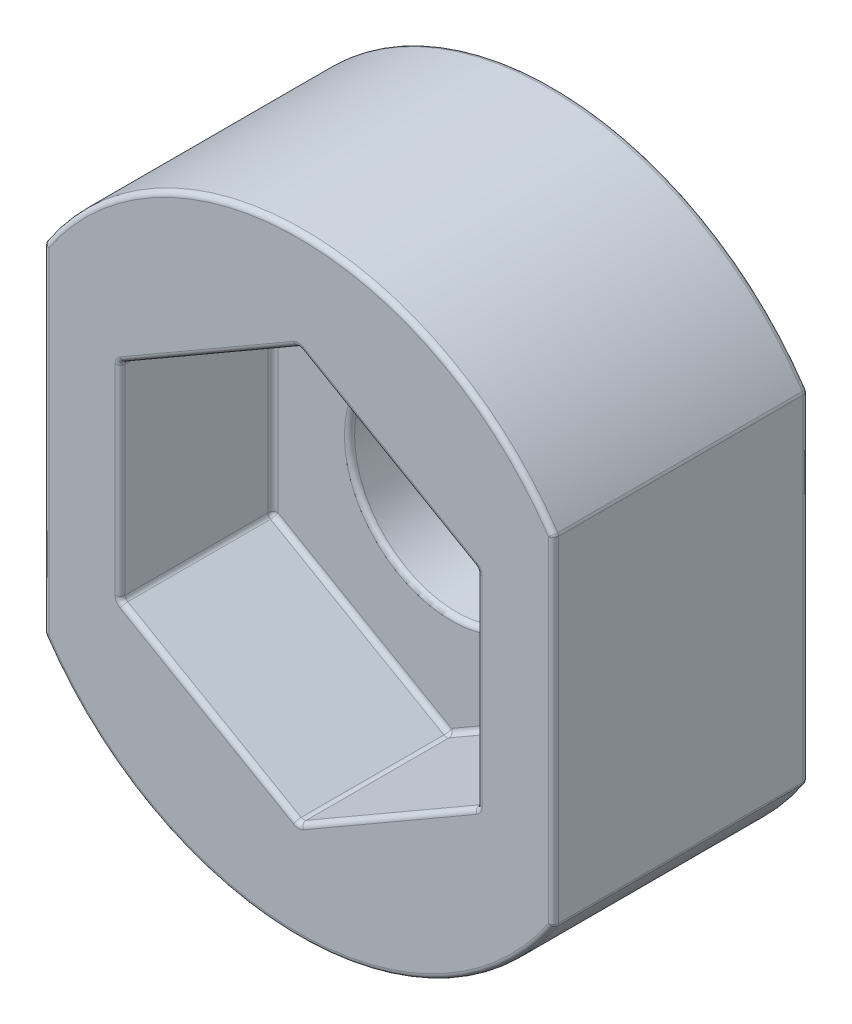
ISO-10303-21;
HEADER;
FILE_DESCRIPTION(('STEP AP214'),'2;1');
FILE_NAME('part.step','',(''),(''),'','','');
FILE_SCHEMA(('AUTOMOTIVE_DESIGN { 1 0 10303 214 1 1 1 1 }'));
ENDSEC;
DATA;
#1=APPLICATION_CONTEXT('core data for automotive mechanical design processes');
#2=APPLICATION_PROTOCOL_DEFINITION('international standard','automotive_design',2000,#1);
#3=PRODUCT_CONTEXT('',#1,'mechanical');
#4=PRODUCT('Part','Part','',(#3));
#5=PRODUCT_RELATED_PRODUCT_CATEGORY('part','',(#4));
#6=PRODUCT_DEFINITION_FORMATION('','',#4);
#7=PRODUCT_DEFINITION_CONTEXT('part definition',#1,'design');
#8=PRODUCT_DEFINITION('design','',#6,#7);
#9=PRODUCT_DEFINITION_SHAPE('','',#8);
#10=(LENGTH_UNIT() NAMED_UNIT(*) SI_UNIT(.MILLI.,.METRE.));
#11=(NAMED_UNIT(*) PLANE_ANGLE_UNIT() SI_UNIT($,.RADIAN.));
#12=(NAMED_UNIT(*) SI_UNIT($,.STERADIAN.) SOLID_ANGLE_UNIT());
#13=UNCERTAINTY_MEASURE_WITH_UNIT(LENGTH_MEASURE(1.E-05),#10,'distance_accuracy_value','');
#14=(GEOMETRIC_REPRESENTATION_CONTEXT(3) GLOBAL_UNCERTAINTY_ASSIGNED_CONTEXT((#13)) GLOBAL_UNIT_ASSIGNED_CONTEXT((#10,
#11,#12)) REPRESENTATION_CONTEXT('',''));
#15=CARTESIAN_POINT('',(0.,0.,0.));
#16=DIRECTION('',(0.,0.,1.));
#17=DIRECTION('',(1.,0.,0.));
#18=AXIS2_PLACEMENT_3D('',#15,#16,#17);
#19=CARTESIAN_POINT('',(0.,0.,5.));
#20=DIRECTION('',(0.,0.,-1.));
#21=DIRECTION('',(-1.,0.,0.));
#22=AXIS2_PLACEMENT_3D('',#19,#20,#21);
#23=CYLINDRICAL_SURFACE('',#22,6.);
#24=DIRECTION('',(0.,0.,-1.));
#25=VECTOR('',#24,1.);
#26=CARTESIAN_POINT('',(-4.98305084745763,-3.34203594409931,5.));
#27=LINE('',#26,#25);
#28=CARTESIAN_POINT('',(-4.98305084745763,-3.34203594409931,4.9));
#29=VERTEX_POINT('',#28);
#30=CARTESIAN_POINT('',(-4.98305084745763,-3.34203594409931,0.1));
#31=VERTEX_POINT('',#30);
#32=EDGE_CURVE('E366',#29,#31,#27,.T.);
#33=ORIENTED_EDGE('',*,*,#32,.T.);
#34=CARTESIAN_POINT('',(0.,0.,0.1));
#35=DIRECTION('',(0.,0.,1.));
#36=DIRECTION('',(1.,0.,0.));
#37=AXIS2_PLACEMENT_3D('',#34,#35,#36);
#38=CIRCLE('',#37,6.);
#39=CARTESIAN_POINT('',(4.98305084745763,-3.34203594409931,0.1));
#40=VERTEX_POINT('',#39);
#41=EDGE_CURVE('E368',#31,#40,#38,.T.);
#42=ORIENTED_EDGE('',*,*,#41,.T.);
#43=DIRECTION('',(0.,0.,-1.));
#44=VECTOR('',#43,1.);
#45=CARTESIAN_POINT('',(4.98305084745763,-3.34203594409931,5.));
#46=LINE('',#45,#44);
#47=CARTESIAN_POINT('',(4.98305084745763,-3.34203594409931,4.9));
#48=VERTEX_POINT('',#47);
#49=EDGE_CURVE('E364',#40,#48,#46,.F.);
#50=ORIENTED_EDGE('',*,*,#49,.T.);
#51=CARTESIAN_POINT('',(0.,0.,4.9));
#52=DIRECTION('',(0.,0.,1.));
#53=DIRECTION('',(1.,0.,0.));
#54=AXIS2_PLACEMENT_3D('',#51,#52,#53);
#55=CIRCLE('',#54,6.);
#56=EDGE_CURVE('E362',#48,#29,#55,.F.);
#57=ORIENTED_EDGE('',*,*,#56,.T.);
#58=EDGE_LOOP('',(#33,#42,#50,#57));
#59=FACE_BOUND('',#58,.T.);
#60=ADVANCED_FACE('F33',(#59),#23,.T.);
#61=DIRECTION('',(0.,0.,-1.));
#62=VECTOR('',#61,1.);
#63=CARTESIAN_POINT('',(4.98305084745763,3.34203594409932,5.));
#64=LINE('',#63,#62);
#65=CARTESIAN_POINT('',(4.98305084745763,3.34203594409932,4.9));
#66=VERTEX_POINT('',#65);
#67=CARTESIAN_POINT('',(4.98305084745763,3.34203594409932,0.1));
#68=VERTEX_POINT('',#67);
#69=EDGE_CURVE('E384',#66,#68,#64,.T.);
#70=ORIENTED_EDGE('',*,*,#69,.T.);
#71=CARTESIAN_POINT('',(0.,0.,0.1));
#72=DIRECTION('',(0.,0.,1.));
#73=DIRECTION('',(1.,0.,0.));
#74=AXIS2_PLACEMENT_3D('',#71,#72,#73);
#75=CIRCLE('',#74,6.);
#76=CARTESIAN_POINT('',(-4.98305084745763,3.34203594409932,0.1));
#77=VERTEX_POINT('',#76);
#78=EDGE_CURVE('E387',#68,#77,#75,.T.);
#79=ORIENTED_EDGE('',*,*,#78,.T.);
#80=DIRECTION('',(0.,0.,-1.));
#81=VECTOR('',#80,1.);
#82=CARTESIAN_POINT('',(-4.98305084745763,3.34203594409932,5.));
#83=LINE('',#82,#81);
#84=CARTESIAN_POINT('',(-4.98305084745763,3.34203594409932,4.9));
#85=VERTEX_POINT('',#84);
#86=EDGE_CURVE('E382',#77,#85,#83,.F.);
#87=ORIENTED_EDGE('',*,*,#86,.T.);
#88=CARTESIAN_POINT('',(0.,0.,4.9));
#89=DIRECTION('',(0.,0.,1.));
#90=DIRECTION('',(1.,0.,0.));
#91=AXIS2_PLACEMENT_3D('',#88,#89,#90);
#92=CIRCLE('',#91,6.);
#93=EDGE_CURVE('E380',#85,#66,#92,.F.);
#94=ORIENTED_EDGE('',*,*,#93,.T.);
#95=EDGE_LOOP('',(#70,#79,#87,#94));
#96=FACE_BOUND('',#95,.T.);
#97=ADVANCED_FACE('F35',(#96),#23,.T.);
#98=CARTESIAN_POINT('',(0.,0.,5.));
#99=DIRECTION('',(0.,0.,1.));
#100=DIRECTION('',(1.,0.,0.));
#101=AXIS2_PLACEMENT_3D('',#98,#99,#100);
#102=PLANE('',#101);
#103=CARTESIAN_POINT('',(0.,-3.92598183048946,5.));
#104=DIRECTION('',(0.,0.,1.));
#105=DIRECTION('',(1.,0.,0.));
#106=AXIS2_PLACEMENT_3D('',#103,#104,#105);
#107=CIRCLE('',#106,0.2);
#108=CARTESIAN_POINT('',(-0.1,-4.09918691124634,5.));
#109=VERTEX_POINT('',#108);
#110=CARTESIAN_POINT('',(0.099999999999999,-4.09918691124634,5.));
#111=VERTEX_POINT('',#110);
#112=EDGE_CURVE('E421',#109,#111,#107,.T.);
#113=ORIENTED_EDGE('',*,*,#112,.F.);
#114=DIRECTION('',(0.866025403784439,-0.5,0.));
#115=VECTOR('',#114,1.);
#116=CARTESIAN_POINT('',(-3.55,-2.10732848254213,5.));
#117=LINE('',#116,#115);
#118=CARTESIAN_POINT('',(-3.5,-2.13619599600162,5.));
#119=VERTEX_POINT('',#118);
#120=EDGE_CURVE('E427',#109,#119,#117,.F.);
#121=ORIENTED_EDGE('',*,*,#120,.T.);
#122=CARTESIAN_POINT('',(-3.4,-1.96299091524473,5.));
#123=DIRECTION('',(0.,0.,1.));
#124=DIRECTION('',(1.,0.,0.));
#125=AXIS2_PLACEMENT_3D('',#122,#123,#124);
#126=CIRCLE('',#125,0.2);
#127=CARTESIAN_POINT('',(-3.6,-1.96299091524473,5.));
#128=VERTEX_POINT('',#127);
#129=EDGE_CURVE('E424',#128,#119,#126,.T.);
#130=ORIENTED_EDGE('',*,*,#129,.F.);
#131=DIRECTION('',(0.,-1.,0.));
#132=VECTOR('',#131,1.);
#133=CARTESIAN_POINT('',(-3.6,2.02072594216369,5.));
#134=LINE('',#133,#132);
#135=CARTESIAN_POINT('',(-3.6,1.96299091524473,5.));
#136=VERTEX_POINT('',#135);
#137=EDGE_CURVE('E419',#128,#136,#134,.F.);
#138=ORIENTED_EDGE('',*,*,#137,.T.);
#139=CARTESIAN_POINT('',(-3.4,1.96299091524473,5.));
#140=DIRECTION('',(0.,0.,1.));
#141=DIRECTION('',(1.,0.,0.));
#142=AXIS2_PLACEMENT_3D('',#139,#140,#141);
#143=CIRCLE('',#142,0.2);
#144=CARTESIAN_POINT('',(-3.5,2.13619599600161,5.));
#145=VERTEX_POINT('',#144);
#146=EDGE_CURVE('E416',#145,#136,#143,.T.);
#147=ORIENTED_EDGE('',*,*,#146,.F.);
#148=DIRECTION('',(-0.866025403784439,-0.5,0.));
#149=VECTOR('',#148,1.);
#150=CARTESIAN_POINT('',(-0.0500000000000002,4.12805442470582,5.));
#151=LINE('',#150,#149);
#152=CARTESIAN_POINT('',(-0.1,4.09918691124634,5.));
#153=VERTEX_POINT('',#152);
#154=EDGE_CURVE('E408',#145,#153,#151,.F.);
#155=ORIENTED_EDGE('',*,*,#154,.T.);
#156=CARTESIAN_POINT('',(0.,3.92598183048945,5.));
#157=DIRECTION('',(0.,0.,1.));
#158=DIRECTION('',(1.,0.,0.));
#159=AXIS2_PLACEMENT_3D('',#156,#157,#158);
#160=CIRCLE('',#159,0.2);
#161=CARTESIAN_POINT('',(0.1,4.09918691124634,5.));
#162=VERTEX_POINT('',#161);
#163=EDGE_CURVE('E405',#162,#153,#160,.T.);
#164=ORIENTED_EDGE('',*,*,#163,.F.);
#165=DIRECTION('',(-0.866025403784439,0.5,0.));
#166=VECTOR('',#165,1.);
#167=CARTESIAN_POINT('',(3.55,2.10732848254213,5.));
#168=LINE('',#167,#166);
#169=CARTESIAN_POINT('',(3.5,2.13619599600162,5.));
#170=VERTEX_POINT('',#169);
#171=EDGE_CURVE('E401',#162,#170,#168,.F.);
#172=ORIENTED_EDGE('',*,*,#171,.T.);
#173=CARTESIAN_POINT('',(3.4,1.96299091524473,5.));
#174=DIRECTION('',(0.,0.,1.));
#175=DIRECTION('',(1.,0.,0.));
#176=AXIS2_PLACEMENT_3D('',#173,#174,#175);
#177=CIRCLE('',#176,0.2);
#178=CARTESIAN_POINT('',(3.6,1.96299091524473,5.));
#179=VERTEX_POINT('',#178);
#180=EDGE_CURVE('E398',#179,#170,#177,.T.);
#181=ORIENTED_EDGE('',*,*,#180,.F.);
#182=DIRECTION('',(0.,1.,0.));
#183=VECTOR('',#182,1.);
#184=CARTESIAN_POINT('',(3.6,-2.02072594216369,5.));
#185=LINE('',#184,#183);
#186=CARTESIAN_POINT('',(3.6,-1.96299091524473,5.));
#187=VERTEX_POINT('',#186);
#188=EDGE_CURVE('E403',#179,#187,#185,.F.);
#189=ORIENTED_EDGE('',*,*,#188,.T.);
#190=CARTESIAN_POINT('',(3.4,-1.96299091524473,5.));
#191=DIRECTION('',(0.,0.,1.));
#192=DIRECTION('',(1.,0.,0.));
#193=AXIS2_PLACEMENT_3D('',#190,#191,#192);
#194=CIRCLE('',#193,0.2);
#195=CARTESIAN_POINT('',(3.5,-2.13619599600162,5.));
#196=VERTEX_POINT('',#195);
#197=EDGE_CURVE('E411',#196,#187,#194,.T.);
#198=ORIENTED_EDGE('',*,*,#197,.F.);
#199=DIRECTION('',(0.866025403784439,0.5,0.));
#200=VECTOR('',#199,1.);
#201=CARTESIAN_POINT('',(0.0499999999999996,-4.12805442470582,5.));
#202=LINE('',#201,#200);
#203=EDGE_CURVE('E414',#196,#111,#202,.F.);
#204=ORIENTED_EDGE('',*,*,#203,.T.);
#205=EDGE_LOOP('',(#113,#121,#130,#138,#147,#155,#164,#172,#181,#189,#198,#204));
#206=FACE_BOUND('',#205,.T.);
#207=DIRECTION('',(0.,-1.,0.));
#208=VECTOR('',#207,1.);
#209=CARTESIAN_POINT('',(4.9,3.3166247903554,5.));
#210=LINE('',#209,#208);
#211=CARTESIAN_POINT('',(4.9,-3.28633534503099,5.));
#212=VERTEX_POINT('',#211);
#213=CARTESIAN_POINT('',(4.9,3.28633534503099,5.));
#214=VERTEX_POINT('',#213);
#215=EDGE_CURVE('E393',#212,#214,#210,.F.);
#216=ORIENTED_EDGE('',*,*,#215,.T.);
#217=CARTESIAN_POINT('',(0.,0.,5.));
#218=DIRECTION('',(0.,0.,1.));
#219=DIRECTION('',(1.,0.,0.));
#220=AXIS2_PLACEMENT_3D('',#217,#218,#219);
#221=CIRCLE('',#220,5.9);
#222=CARTESIAN_POINT('',(-4.9,3.28633534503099,5.));
#223=VERTEX_POINT('',#222);
#224=EDGE_CURVE('E395',#214,#223,#221,.T.);
#225=ORIENTED_EDGE('',*,*,#224,.T.);
#226=DIRECTION('',(0.,1.,0.));
#227=VECTOR('',#226,1.);
#228=CARTESIAN_POINT('',(-4.9,-3.31662479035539,5.));
#229=LINE('',#228,#227);
#230=CARTESIAN_POINT('',(-4.9,-3.28633534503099,5.));
#231=VERTEX_POINT('',#230);
#232=EDGE_CURVE('E389',#223,#231,#229,.F.);
#233=ORIENTED_EDGE('',*,*,#232,.T.);
#234=CARTESIAN_POINT('',(0.,0.,5.));
#235=DIRECTION('',(0.,0.,1.));
#236=DIRECTION('',(1.,0.,0.));
#237=AXIS2_PLACEMENT_3D('',#234,#235,#236);
#238=CIRCLE('',#237,5.9);
#239=EDGE_CURVE('E391',#231,#212,#238,.T.);
#240=ORIENTED_EDGE('',*,*,#239,.T.);
#241=EDGE_LOOP('',(#216,#225,#233,#240));
#242=FACE_BOUND('',#241,.T.);
#243=ADVANCED_FACE('F507',(#206,#242),#102,.T.);
#244=CARTESIAN_POINT('',(0.,0.,0.));
#245=DIRECTION('',(0.,0.,1.));
#246=DIRECTION('',(1.,0.,0.));
#247=AXIS2_PLACEMENT_3D('',#244,#245,#246);
#248=PLANE('',#247);
#249=CARTESIAN_POINT('',(0.,0.,0.));
#250=DIRECTION('',(0.,0.,1.));
#251=DIRECTION('',(1.,0.,0.));
#252=AXIS2_PLACEMENT_3D('',#249,#250,#251);
#253=CIRCLE('',#252,2.1);
#254=CARTESIAN_POINT('',(2.1,0.,0.));
#255=VERTEX_POINT('',#254);
#256=EDGE_CURVE('E344',#255,#255,#253,.T.);
#257=ORIENTED_EDGE('',*,*,#256,.T.);
#258=EDGE_LOOP('',(#257));
#259=FACE_BOUND('',#258,.T.);
#260=CARTESIAN_POINT('',(0.,0.,0.));
#261=DIRECTION('',(0.,0.,1.));
#262=DIRECTION('',(1.,0.,0.));
#263=AXIS2_PLACEMENT_3D('',#260,#261,#262);
#264=CIRCLE('',#263,5.9);
#265=CARTESIAN_POINT('',(4.9,-3.28633534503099,0.));
#266=VERTEX_POINT('',#265);
#267=CARTESIAN_POINT('',(-4.9,-3.28633534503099,0.));
#268=VERTEX_POINT('',#267);
#269=EDGE_CURVE('E339',#266,#268,#264,.F.);
#270=ORIENTED_EDGE('',*,*,#269,.T.);
#271=DIRECTION('',(0.,1.,0.));
#272=VECTOR('',#271,1.);
#273=CARTESIAN_POINT('',(-4.9,0.,0.));
#274=LINE('',#273,#272);
#275=CARTESIAN_POINT('',(-4.9,3.28633534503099,0.));
#276=VERTEX_POINT('',#275);
#277=EDGE_CURVE('E341',#268,#276,#274,.T.);
#278=ORIENTED_EDGE('',*,*,#277,.T.);
#279=CARTESIAN_POINT('',(0.,0.,0.));
#280=DIRECTION('',(0.,0.,1.));
#281=DIRECTION('',(1.,0.,0.));
#282=AXIS2_PLACEMENT_3D('',#279,#280,#281);
#283=CIRCLE('',#282,5.9);
#284=CARTESIAN_POINT('',(4.9,3.28633534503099,0.));
#285=VERTEX_POINT('',#284);
#286=EDGE_CURVE('E335',#276,#285,#283,.F.);
#287=ORIENTED_EDGE('',*,*,#286,.T.);
#288=DIRECTION('',(0.,-1.,0.));
#289=VECTOR('',#288,1.);
#290=CARTESIAN_POINT('',(4.9,0.,0.));
#291=LINE('',#290,#289);
#292=EDGE_CURVE('E337',#285,#266,#291,.T.);
#293=ORIENTED_EDGE('',*,*,#292,.T.);
#294=EDGE_LOOP('',(#270,#278,#287,#293));
#295=FACE_BOUND('',#294,.T.);
#296=ADVANCED_FACE('F597',(#259,#295),#248,.F.);
#297=CARTESIAN_POINT('',(3.5,2.02072594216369,2.));
#298=DIRECTION('',(0.5,0.866025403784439,0.));
#299=DIRECTION('',(-0.866025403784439,0.5,0.));
#300=AXIS2_PLACEMENT_3D('',#297,#298,#299);
#301=PLANE('',#300);
#302=DIRECTION('',(0.,0.,1.));
#303=VECTOR('',#302,1.);
#304=CARTESIAN_POINT('',(3.45,2.04959345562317,5.));
#305=LINE('',#304,#303);
#306=CARTESIAN_POINT('',(3.45,2.04959345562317,2.1));
#307=VERTEX_POINT('',#306);
#308=CARTESIAN_POINT('',(3.45,2.04959345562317,4.9));
#309=VERTEX_POINT('',#308);
#310=EDGE_CURVE('E330',#307,#309,#305,.T.);
#311=ORIENTED_EDGE('',*,*,#310,.T.);
#312=DIRECTION('',(-0.866025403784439,0.5,0.));
#313=VECTOR('',#312,1.);
#314=CARTESIAN_POINT('',(0.,4.04145188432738,4.9));
#315=LINE('',#314,#313);
#316=CARTESIAN_POINT('',(0.0500000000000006,4.0125843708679,4.9));
#317=VERTEX_POINT('',#316);
#318=EDGE_CURVE('E333',#309,#317,#315,.T.);
#319=ORIENTED_EDGE('',*,*,#318,.T.);
#320=DIRECTION('',(0.,0.,1.));
#321=VECTOR('',#320,1.);
#322=CARTESIAN_POINT('',(0.0500000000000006,4.0125843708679,2.));
#323=LINE('',#322,#321);
#324=CARTESIAN_POINT('',(0.0500000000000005,4.0125843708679,2.1));
#325=VERTEX_POINT('',#324);
#326=EDGE_CURVE('E328',#317,#325,#323,.F.);
#327=ORIENTED_EDGE('',*,*,#326,.T.);
#328=DIRECTION('',(-0.866025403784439,0.5,0.));
#329=VECTOR('',#328,1.);
#330=CARTESIAN_POINT('',(3.5,2.02072594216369,2.1));
#331=LINE('',#330,#329);
#332=EDGE_CURVE('E326',#325,#307,#331,.F.);
#333=ORIENTED_EDGE('',*,*,#332,.T.);
#334=EDGE_LOOP('',(#311,#319,#327,#333));
#335=FACE_BOUND('',#334,.T.);
#336=ADVANCED_FACE('F595',(#335),#301,.F.);
#337=CARTESIAN_POINT('',(3.5,-2.02072594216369,2.));
#338=DIRECTION('',(1.,0.,0.));
#339=DIRECTION('',(0.,1.,0.));
#340=AXIS2_PLACEMENT_3D('',#337,#338,#339);
#341=PLANE('',#340);
#342=DIRECTION('',(0.,0.,1.));
#343=VECTOR('',#342,1.);
#344=CARTESIAN_POINT('',(3.5,-1.96299091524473,5.));
#345=LINE('',#344,#343);
#346=CARTESIAN_POINT('',(3.5,-1.96299091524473,2.1));
#347=VERTEX_POINT('',#346);
#348=CARTESIAN_POINT('',(3.5,-1.96299091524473,4.9));
#349=VERTEX_POINT('',#348);
#350=EDGE_CURVE('E321',#347,#349,#345,.T.);
#351=ORIENTED_EDGE('',*,*,#350,.T.);
#352=DIRECTION('',(0.,1.,0.));
#353=VECTOR('',#352,1.);
#354=CARTESIAN_POINT('',(3.5,2.02072594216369,4.9));
#355=LINE('',#354,#353);
#356=CARTESIAN_POINT('',(3.5,1.96299091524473,4.9));
#357=VERTEX_POINT('',#356);
#358=EDGE_CURVE('E324',#349,#357,#355,.T.);
#359=ORIENTED_EDGE('',*,*,#358,.T.);
#360=DIRECTION('',(0.,0.,1.));
#361=VECTOR('',#360,1.);
#362=CARTESIAN_POINT('',(3.5,1.96299091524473,2.));
#363=LINE('',#362,#361);
#364=CARTESIAN_POINT('',(3.5,1.96299091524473,2.1));
#365=VERTEX_POINT('',#364);
#366=EDGE_CURVE('E319',#357,#365,#363,.F.);
#367=ORIENTED_EDGE('',*,*,#366,.T.);
#368=DIRECTION('',(0.,1.,0.));
#369=VECTOR('',#368,1.);
#370=CARTESIAN_POINT('',(3.5,-2.02072594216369,2.1));
#371=LINE('',#370,#369);
#372=EDGE_CURVE('E317',#365,#347,#371,.F.);
#373=ORIENTED_EDGE('',*,*,#372,.T.);
#374=EDGE_LOOP('',(#351,#359,#367,#373));
#375=FACE_BOUND('',#374,.T.);
#376=ADVANCED_FACE('F516',(#375),#341,.F.);
#377=CARTESIAN_POINT('',(0.,-4.04145188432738,2.));
#378=DIRECTION('',(0.5,-0.866025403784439,0.));
#379=DIRECTION('',(0.866025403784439,0.5,0.));
#380=AXIS2_PLACEMENT_3D('',#377,#378,#379);
#381=PLANE('',#380);
#382=DIRECTION('',(0.,0.,1.));
#383=VECTOR('',#382,1.);
#384=CARTESIAN_POINT('',(0.0499999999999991,-4.0125843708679,5.));
#385=LINE('',#384,#383);
#386=CARTESIAN_POINT('',(0.049999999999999,-4.0125843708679,2.1));
#387=VERTEX_POINT('',#386);
#388=CARTESIAN_POINT('',(0.0499999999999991,-4.0125843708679,4.9));
#389=VERTEX_POINT('',#388);
#390=EDGE_CURVE('E312',#387,#389,#385,.T.);
#391=ORIENTED_EDGE('',*,*,#390,.T.);
#392=DIRECTION('',(0.866025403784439,0.5,0.));
#393=VECTOR('',#392,1.);
#394=CARTESIAN_POINT('',(3.5,-2.02072594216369,4.9));
#395=LINE('',#394,#393);
#396=CARTESIAN_POINT('',(3.45,-2.04959345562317,4.9));
#397=VERTEX_POINT('',#396);
#398=EDGE_CURVE('E315',#389,#397,#395,.T.);
#399=ORIENTED_EDGE('',*,*,#398,.T.);
#400=DIRECTION('',(0.,0.,1.));
#401=VECTOR('',#400,1.);
#402=CARTESIAN_POINT('',(3.45,-2.04959345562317,2.));
#403=LINE('',#402,#401);
#404=CARTESIAN_POINT('',(3.45,-2.04959345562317,2.1));
#405=VERTEX_POINT('',#404);
#406=EDGE_CURVE('E310',#397,#405,#403,.F.);
#407=ORIENTED_EDGE('',*,*,#406,.T.);
#408=DIRECTION('',(0.866025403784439,0.5,0.));
#409=VECTOR('',#408,1.);
#410=CARTESIAN_POINT('',(0.,-4.04145188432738,2.1));
#411=LINE('',#410,#409);
#412=EDGE_CURVE('E308',#405,#387,#411,.F.);
#413=ORIENTED_EDGE('',*,*,#412,.T.);
#414=EDGE_LOOP('',(#391,#399,#407,#413));
#415=FACE_BOUND('',#414,.T.);
#416=ADVANCED_FACE('F603',(#415),#381,.F.);
#417=CARTESIAN_POINT('',(-3.5,-2.02072594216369,2.));
#418=DIRECTION('',(-0.5,-0.866025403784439,0.));
#419=DIRECTION('',(0.866025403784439,-0.5,0.));
#420=AXIS2_PLACEMENT_3D('',#417,#418,#419);
#421=PLANE('',#420);
#422=DIRECTION('',(0.,0.,1.));
#423=VECTOR('',#422,1.);
#424=CARTESIAN_POINT('',(-3.45,-2.04959345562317,5.));
#425=LINE('',#424,#423);
#426=CARTESIAN_POINT('',(-3.45,-2.04959345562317,2.1));
#427=VERTEX_POINT('',#426);
#428=CARTESIAN_POINT('',(-3.45,-2.04959345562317,4.9));
#429=VERTEX_POINT('',#428);
#430=EDGE_CURVE('E264',#427,#429,#425,.T.);
#431=ORIENTED_EDGE('',*,*,#430,.T.);
#432=DIRECTION('',(0.866025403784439,-0.5,0.));
#433=VECTOR('',#432,1.);
#434=CARTESIAN_POINT('',(0.,-4.04145188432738,4.9));
#435=LINE('',#434,#433);
#436=CARTESIAN_POINT('',(-0.0500000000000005,-4.0125843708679,4.9));
#437=VERTEX_POINT('',#436);
#438=EDGE_CURVE('E306',#429,#437,#435,.T.);
#439=ORIENTED_EDGE('',*,*,#438,.T.);
#440=DIRECTION('',(0.,0.,1.));
#441=VECTOR('',#440,1.);
#442=CARTESIAN_POINT('',(-0.0500000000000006,-4.0125843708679,2.));
#443=LINE('',#442,#441);
#444=CARTESIAN_POINT('',(-0.0500000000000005,-4.0125843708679,2.1));
#445=VERTEX_POINT('',#444);
#446=EDGE_CURVE('E303',#437,#445,#443,.F.);
#447=ORIENTED_EDGE('',*,*,#446,.T.);
#448=DIRECTION('',(0.866025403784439,-0.5,0.));
#449=VECTOR('',#448,1.);
#450=CARTESIAN_POINT('',(-3.5,-2.02072594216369,2.1));
#451=LINE('',#450,#449);
#452=EDGE_CURVE('E301',#445,#427,#451,.F.);
#453=ORIENTED_EDGE('',*,*,#452,.T.);
#454=EDGE_LOOP('',(#431,#439,#447,#453));
#455=FACE_BOUND('',#454,.T.);
#456=ADVANCED_FACE('F716',(#455),#421,.F.);
#457=CARTESIAN_POINT('',(-3.5,2.02072594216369,2.));
#458=DIRECTION('',(-1.,0.,0.));
#459=DIRECTION('',(0.,-1.,0.));
#460=AXIS2_PLACEMENT_3D('',#457,#458,#459);
#461=PLANE('',#460);
#462=DIRECTION('',(0.,0.,1.));
#463=VECTOR('',#462,1.);
#464=CARTESIAN_POINT('',(-3.5,1.96299091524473,5.));
#465=LINE('',#464,#463);
#466=CARTESIAN_POINT('',(-3.5,1.96299091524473,2.1));
#467=VERTEX_POINT('',#466);
#468=CARTESIAN_POINT('',(-3.5,1.96299091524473,4.9));
#469=VERTEX_POINT('',#468);
#470=EDGE_CURVE('E256',#467,#469,#465,.T.);
#471=ORIENTED_EDGE('',*,*,#470,.T.);
#472=DIRECTION('',(0.,-1.,0.));
#473=VECTOR('',#472,1.);
#474=CARTESIAN_POINT('',(-3.5,-2.02072594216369,4.9));
#475=LINE('',#474,#473);
#476=CARTESIAN_POINT('',(-3.5,-1.96299091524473,4.9));
#477=VERTEX_POINT('',#476);
#478=EDGE_CURVE('E252',#469,#477,#475,.T.);
#479=ORIENTED_EDGE('',*,*,#478,.T.);
#480=DIRECTION('',(0.,0.,1.));
#481=VECTOR('',#480,1.);
#482=CARTESIAN_POINT('',(-3.5,-1.96299091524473,2.));
#483=LINE('',#482,#481);
#484=CARTESIAN_POINT('',(-3.5,-1.96299091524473,2.1));
#485=VERTEX_POINT('',#484);
#486=EDGE_CURVE('E244',#477,#485,#483,.F.);
#487=ORIENTED_EDGE('',*,*,#486,.T.);
#488=DIRECTION('',(0.,-1.,0.));
#489=VECTOR('',#488,1.);
#490=CARTESIAN_POINT('',(-3.5,2.02072594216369,2.1));
#491=LINE('',#490,#489);
#492=EDGE_CURVE('E249',#485,#467,#491,.F.);
#493=ORIENTED_EDGE('',*,*,#492,.T.);
#494=EDGE_LOOP('',(#471,#479,#487,#493));
#495=FACE_BOUND('',#494,.T.);
#496=ADVANCED_FACE('F247',(#495),#461,.F.);
#497=CARTESIAN_POINT('',(0.,4.04145188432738,2.));
#498=DIRECTION('',(-0.5,0.866025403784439,0.));
#499=DIRECTION('',(-0.866025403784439,-0.5,0.));
#500=AXIS2_PLACEMENT_3D('',#497,#498,#499);
#501=PLANE('',#500);
#502=DIRECTION('',(0.,0.,1.));
#503=VECTOR('',#502,1.);
#504=CARTESIAN_POINT('',(-0.0500000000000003,4.0125843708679,5.));
#505=LINE('',#504,#503);
#506=CARTESIAN_POINT('',(-0.0500000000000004,4.0125843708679,2.1));
#507=VERTEX_POINT('',#506);
#508=CARTESIAN_POINT('',(-0.0500000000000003,4.0125843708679,4.9));
#509=VERTEX_POINT('',#508);
#510=EDGE_CURVE('E294',#507,#509,#505,.T.);
#511=ORIENTED_EDGE('',*,*,#510,.T.);
#512=DIRECTION('',(-0.866025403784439,-0.5,0.));
#513=VECTOR('',#512,1.);
#514=CARTESIAN_POINT('',(-3.5,2.02072594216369,4.9));
#515=LINE('',#514,#513);
#516=CARTESIAN_POINT('',(-3.45,2.04959345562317,4.9));
#517=VERTEX_POINT('',#516);
#518=EDGE_CURVE('E299',#509,#517,#515,.T.);
#519=ORIENTED_EDGE('',*,*,#518,.T.);
#520=DIRECTION('',(0.,0.,1.));
#521=VECTOR('',#520,1.);
#522=CARTESIAN_POINT('',(-3.45,2.04959345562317,2.));
#523=LINE('',#522,#521);
#524=CARTESIAN_POINT('',(-3.45,2.04959345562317,2.1));
#525=VERTEX_POINT('',#524);
#526=EDGE_CURVE('E296',#517,#525,#523,.F.);
#527=ORIENTED_EDGE('',*,*,#526,.T.);
#528=DIRECTION('',(-0.866025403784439,-0.5,0.));
#529=VECTOR('',#528,1.);
#530=CARTESIAN_POINT('',(0.,4.04145188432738,2.1));
#531=LINE('',#530,#529);
#532=EDGE_CURVE('E292',#525,#507,#531,.F.);
#533=ORIENTED_EDGE('',*,*,#532,.T.);
#534=EDGE_LOOP('',(#511,#519,#527,#533));
#535=FACE_BOUND('',#534,.T.);
#536=ADVANCED_FACE('F708',(#535),#501,.F.);
#537=CARTESIAN_POINT('',(7.,0.,2.));
#538=DIRECTION('',(0.,0.,-1.));
#539=DIRECTION('',(-1.,0.,0.));
#540=AXIS2_PLACEMENT_3D('',#537,#538,#539);
#541=PLANE('',#540);
#542=DIRECTION('',(0.866025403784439,0.5,0.));
#543=VECTOR('',#542,1.);
#544=CARTESIAN_POINT('',(3.45,-1.93412340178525,2.));
#545=LINE('',#544,#543);
#546=CARTESIAN_POINT('',(0.,-3.92598183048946,2.));
#547=VERTEX_POINT('',#546);
#548=CARTESIAN_POINT('',(3.4,-1.96299091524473,2.));
#549=VERTEX_POINT('',#548);
#550=EDGE_CURVE('E41',#547,#549,#545,.T.);
#551=ORIENTED_EDGE('',*,*,#550,.T.);
#552=DIRECTION('',(0.,1.,0.));
#553=VECTOR('',#552,1.);
#554=CARTESIAN_POINT('',(3.4,2.02072594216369,2.));
#555=LINE('',#554,#553);
#556=CARTESIAN_POINT('',(3.4,1.96299091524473,2.));
#557=VERTEX_POINT('',#556);
#558=EDGE_CURVE('E11',#549,#557,#555,.T.);
#559=ORIENTED_EDGE('',*,*,#558,.T.);
#560=DIRECTION('',(-0.866025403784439,0.5,0.));
#561=VECTOR('',#560,1.);
#562=CARTESIAN_POINT('',(-0.0500000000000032,3.95484934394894,2.));
#563=LINE('',#562,#561);
#564=CARTESIAN_POINT('',(0.,3.92598183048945,2.));
#565=VERTEX_POINT('',#564);
#566=EDGE_CURVE('E432',#557,#565,#563,.T.);
#567=ORIENTED_EDGE('',*,*,#566,.T.);
#568=DIRECTION('',(-0.866025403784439,-0.5,0.));
#569=VECTOR('',#568,1.);
#570=CARTESIAN_POINT('',(-3.45,1.93412340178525,2.));
#571=LINE('',#570,#569);
#572=CARTESIAN_POINT('',(-3.4,1.96299091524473,2.));
#573=VERTEX_POINT('',#572);
#574=EDGE_CURVE('E434',#565,#573,#571,.T.);
#575=ORIENTED_EDGE('',*,*,#574,.T.);
#576=DIRECTION('',(0.,-1.,0.));
#577=VECTOR('',#576,1.);
#578=CARTESIAN_POINT('',(-3.4,-2.02072594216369,2.));
#579=LINE('',#578,#577);
#580=CARTESIAN_POINT('',(-3.4,-1.96299091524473,2.));
#581=VERTEX_POINT('',#580);
#582=EDGE_CURVE('E436',#573,#581,#579,.T.);
#583=ORIENTED_EDGE('',*,*,#582,.T.);
#584=DIRECTION('',(0.866025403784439,-0.5,0.));
#585=VECTOR('',#584,1.);
#586=CARTESIAN_POINT('',(0.0499999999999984,-3.95484934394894,2.));
#587=LINE('',#586,#585);
#588=EDGE_CURVE('E51',#581,#547,#587,.T.);
#589=ORIENTED_EDGE('',*,*,#588,.T.);
#590=EDGE_LOOP('',(#551,#559,#567,#575,#583,#589));
#591=FACE_BOUND('',#590,.T.);
#592=CARTESIAN_POINT('',(0.,0.,2.));
#593=DIRECTION('',(0.,0.,-1.));
#594=DIRECTION('',(-1.,0.,0.));
#595=AXIS2_PLACEMENT_3D('',#592,#593,#594);
#596=CIRCLE('',#595,2.1);
#597=CARTESIAN_POINT('',(-2.1,0.,2.));
#598=VERTEX_POINT('',#597);
#599=EDGE_CURVE('E429',#598,#598,#596,.T.);
#600=ORIENTED_EDGE('',*,*,#599,.T.);
#601=EDGE_LOOP('',(#600));
#602=FACE_BOUND('',#601,.T.);
#603=ADVANCED_FACE('F438',(#591,#602),#541,.F.);
#604=CARTESIAN_POINT('',(5.,5.62989752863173,0.));
#605=DIRECTION('',(-1.,0.,0.));
#606=DIRECTION('',(0.,-1.,0.));
#607=AXIS2_PLACEMENT_3D('',#604,#605,#606);
#608=PLANE('',#607);
#609=DIRECTION('',(0.,0.,-1.));
#610=VECTOR('',#609,1.);
#611=CARTESIAN_POINT('',(5.,-3.28633534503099,0.));
#612=LINE('',#611,#610);
#613=CARTESIAN_POINT('',(5.,-3.28633534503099,4.9));
#614=VERTEX_POINT('',#613);
#615=CARTESIAN_POINT('',(5.,-3.28633534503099,0.1));
#616=VERTEX_POINT('',#615);
#617=EDGE_CURVE('E375',#614,#616,#612,.T.);
#618=ORIENTED_EDGE('',*,*,#617,.T.);
#619=DIRECTION('',(0.,-1.,0.));
#620=VECTOR('',#619,1.);
#621=CARTESIAN_POINT('',(5.,5.62989752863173,0.1));
#622=LINE('',#621,#620);
#623=CARTESIAN_POINT('',(5.,3.28633534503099,0.1));
#624=VERTEX_POINT('',#623);
#625=EDGE_CURVE('E377',#616,#624,#622,.F.);
#626=ORIENTED_EDGE('',*,*,#625,.T.);
#627=DIRECTION('',(0.,0.,-1.));
#628=VECTOR('',#627,1.);
#629=CARTESIAN_POINT('',(5.,3.28633534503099,0.));
#630=LINE('',#629,#628);
#631=CARTESIAN_POINT('',(5.,3.28633534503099,4.9));
#632=VERTEX_POINT('',#631);
#633=EDGE_CURVE('E373',#624,#632,#630,.F.);
#634=ORIENTED_EDGE('',*,*,#633,.T.);
#635=DIRECTION('',(0.,-1.,0.));
#636=VECTOR('',#635,1.);
#637=CARTESIAN_POINT('',(5.,-3.31662479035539,4.9));
#638=LINE('',#637,#636);
#639=EDGE_CURVE('E371',#632,#614,#638,.T.);
#640=ORIENTED_EDGE('',*,*,#639,.T.);
#641=EDGE_LOOP('',(#618,#626,#634,#640));
#642=FACE_BOUND('',#641,.T.);
#643=ADVANCED_FACE('F714',(#642),#608,.F.);
#644=CARTESIAN_POINT('',(-5.,5.62989752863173,0.));
#645=DIRECTION('',(1.,0.,0.));
#646=DIRECTION('',(0.,1.,0.));
#647=AXIS2_PLACEMENT_3D('',#644,#645,#646);
#648=PLANE('',#647);
#649=DIRECTION('',(0.,0.,-1.));
#650=VECTOR('',#649,1.);
#651=CARTESIAN_POINT('',(-5.,3.28633534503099,0.));
#652=LINE('',#651,#650);
#653=CARTESIAN_POINT('',(-5.,3.28633534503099,4.9));
#654=VERTEX_POINT('',#653);
#655=CARTESIAN_POINT('',(-5.,3.28633534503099,0.1));
#656=VERTEX_POINT('',#655);
#657=EDGE_CURVE('E349',#654,#656,#652,.T.);
#658=ORIENTED_EDGE('',*,*,#657,.T.);
#659=DIRECTION('',(0.,1.,0.));
#660=VECTOR('',#659,1.);
#661=CARTESIAN_POINT('',(-5.,5.62989752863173,0.1));
#662=LINE('',#661,#660);
#663=CARTESIAN_POINT('',(-5.,-3.28633534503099,0.1));
#664=VERTEX_POINT('',#663);
#665=EDGE_CURVE('E353',#656,#664,#662,.F.);
#666=ORIENTED_EDGE('',*,*,#665,.T.);
#667=DIRECTION('',(0.,0.,-1.));
#668=VECTOR('',#667,1.);
#669=CARTESIAN_POINT('',(-5.,-3.28633534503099,0.));
#670=LINE('',#669,#668);
#671=CARTESIAN_POINT('',(-5.,-3.28633534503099,4.9));
#672=VERTEX_POINT('',#671);
#673=EDGE_CURVE('E351',#664,#672,#670,.F.);
#674=ORIENTED_EDGE('',*,*,#673,.T.);
#675=DIRECTION('',(0.,1.,0.));
#676=VECTOR('',#675,1.);
#677=CARTESIAN_POINT('',(-5.,3.3166247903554,4.9));
#678=LINE('',#677,#676);
#679=EDGE_CURVE('E347',#672,#654,#678,.T.);
#680=ORIENTED_EDGE('',*,*,#679,.T.);
#681=EDGE_LOOP('',(#658,#666,#674,#680));
#682=FACE_BOUND('',#681,.T.);
#683=ADVANCED_FACE('F727',(#682),#648,.F.);
#684=CARTESIAN_POINT('',(0.,0.,0.));
#685=DIRECTION('',(0.,0.,1.));
#686=DIRECTION('',(1.,0.,0.));
#687=AXIS2_PLACEMENT_3D('',#684,#685,#686);
#688=CYLINDRICAL_SURFACE('',#687,2.);
#689=CARTESIAN_POINT('',(0.,0.,0.1));
#690=DIRECTION('',(0.,0.,1.));
#691=DIRECTION('',(1.,0.,0.));
#692=AXIS2_PLACEMENT_3D('',#689,#690,#691);
#693=CIRCLE('',#692,2.);
#694=CARTESIAN_POINT('',(2.,0.,0.1));
#695=VERTEX_POINT('',#694);
#696=EDGE_CURVE('E359',#695,#695,#693,.F.);
#697=ORIENTED_EDGE('',*,*,#696,.T.);
#698=EDGE_LOOP('',(#697));
#699=FACE_BOUND('',#698,.T.);
#700=CARTESIAN_POINT('',(0.,0.,1.9));
#701=DIRECTION('',(0.,0.,-1.));
#702=DIRECTION('',(-1.,0.,0.));
#703=AXIS2_PLACEMENT_3D('',#700,#701,#702);
#704=CIRCLE('',#703,2.);
#705=CARTESIAN_POINT('',(-2.,0.,1.9));
#706=VERTEX_POINT('',#705);
#707=EDGE_CURVE('E356',#706,#706,#704,.F.);
#708=ORIENTED_EDGE('',*,*,#707,.T.);
#709=EDGE_LOOP('',(#708));
#710=FACE_BOUND('',#709,.T.);
#711=ADVANCED_FACE('F731',(#699,#710),#688,.F.);
#712=CARTESIAN_POINT('',(3.4,-1.96299091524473,2.));
#713=DIRECTION('',(0.,0.,-1.));
#714=DIRECTION('',(-1.,0.,0.));
#715=AXIS2_PLACEMENT_3D('',#712,#713,#714);
#716=CYLINDRICAL_SURFACE('',#715,0.1);
#717=CARTESIAN_POINT('',(3.4,-1.96299091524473,2.1));
#718=DIRECTION('',(0.,0.,1.));
#719=DIRECTION('',(1.,0.,0.));
#720=AXIS2_PLACEMENT_3D('',#717,#718,#719);
#721=CIRCLE('',#720,0.1);
#722=EDGE_CURVE('E283',#405,#347,#721,.T.);
#723=ORIENTED_EDGE('',*,*,#722,.F.);
#724=ORIENTED_EDGE('',*,*,#406,.F.);
#725=CARTESIAN_POINT('',(3.4,-1.96299091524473,4.9));
#726=DIRECTION('',(0.,0.,1.));
#727=DIRECTION('',(1.,0.,0.));
#728=AXIS2_PLACEMENT_3D('',#725,#726,#727);
#729=CIRCLE('',#728,0.1);
#730=EDGE_CURVE('E286',#349,#397,#729,.F.);
#731=ORIENTED_EDGE('',*,*,#730,.F.);
#732=ORIENTED_EDGE('',*,*,#350,.F.);
#733=EDGE_LOOP('',(#723,#724,#731,#732));
#734=FACE_BOUND('',#733,.T.);
#735=ADVANCED_FACE('F735',(#734),#716,.F.);
#736=CARTESIAN_POINT('',(3.4,-1.96299091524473,2.1));
#737=DIRECTION('',(0.,0.,1.));
#738=DIRECTION('',(1.,0.,0.));
#739=AXIS2_PLACEMENT_3D('',#736,#737,#738);
#740=SPHERICAL_SURFACE('',#739,0.1);
#741=CARTESIAN_POINT('',(3.4,-1.96299091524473,2.1));
#742=DIRECTION('',(-0.866025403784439,-0.5,0.));
#743=DIRECTION('',(0.5,-0.866025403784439,0.));
#744=AXIS2_PLACEMENT_3D('',#741,#742,#743);
#745=CIRCLE('',#744,0.1);
#746=EDGE_CURVE('E488',#405,#549,#745,.F.);
#747=ORIENTED_EDGE('',*,*,#746,.F.);
#748=ORIENTED_EDGE('',*,*,#722,.T.);
#749=CARTESIAN_POINT('',(3.4,-1.96299091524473,2.1));
#750=DIRECTION('',(0.,1.,0.));
#751=DIRECTION('',(0.,0.,1.));
#752=AXIS2_PLACEMENT_3D('',#749,#750,#751);
#753=CIRCLE('',#752,0.1);
#754=EDGE_CURVE('E490',#549,#347,#753,.F.);
#755=ORIENTED_EDGE('',*,*,#754,.F.);
#756=EDGE_LOOP('',(#747,#748,#755));
#757=FACE_BOUND('',#756,.T.);
#758=ADVANCED_FACE('F739',(#757),#740,.F.);
#759=CARTESIAN_POINT('',(3.4,-1.96299091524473,4.9));
#760=DIRECTION('',(0.,0.,1.));
#761=DIRECTION('',(1.,0.,0.));
#762=AXIS2_PLACEMENT_3D('',#759,#760,#761);
#763=TOROIDAL_SURFACE('',#762,0.2,0.1);
#764=CARTESIAN_POINT('',(3.6,-1.96299091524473,4.9));
#765=DIRECTION('',(0.,-1.,0.));
#766=DIRECTION('',(0.,0.,-1.));
#767=AXIS2_PLACEMENT_3D('',#764,#765,#766);
#768=CIRCLE('',#767,0.1);
#769=EDGE_CURVE('E482',#349,#187,#768,.F.);
#770=ORIENTED_EDGE('',*,*,#769,.F.);
#771=ORIENTED_EDGE('',*,*,#730,.T.);
#772=CARTESIAN_POINT('',(3.5,-2.13619599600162,4.9));
#773=DIRECTION('',(0.866025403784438,0.500000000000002,0.));
#774=DIRECTION('',(-0.500000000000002,0.866025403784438,0.));
#775=AXIS2_PLACEMENT_3D('',#772,#773,#774);
#776=CIRCLE('',#775,0.1);
#777=EDGE_CURVE('E485',#196,#397,#776,.F.);
#778=ORIENTED_EDGE('',*,*,#777,.F.);
#779=ORIENTED_EDGE('',*,*,#197,.T.);
#780=EDGE_LOOP('',(#770,#771,#778,#779));
#781=FACE_BOUND('',#780,.T.);
#782=ADVANCED_FACE('F497',(#781),#763,.T.);
#783=CARTESIAN_POINT('',(3.4,0.,2.1));
#784=DIRECTION('',(0.,-1.,0.));
#785=DIRECTION('',(1.,0.,0.));
#786=AXIS2_PLACEMENT_3D('',#783,#784,#785);
#787=CYLINDRICAL_SURFACE('',#786,0.1);
#788=ORIENTED_EDGE('',*,*,#754,.T.);
#789=ORIENTED_EDGE('',*,*,#372,.F.);
#790=CARTESIAN_POINT('',(3.4,1.96299091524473,2.1));
#791=DIRECTION('',(0.,-1.,0.));
#792=DIRECTION('',(1.,0.,0.));
#793=AXIS2_PLACEMENT_3D('',#790,#791,#792);
#794=CIRCLE('',#793,0.1);
#795=EDGE_CURVE('E476',#557,#365,#794,.T.);
#796=ORIENTED_EDGE('',*,*,#795,.F.);
#797=ORIENTED_EDGE('',*,*,#558,.F.);
#798=EDGE_LOOP('',(#788,#789,#796,#797));
#799=FACE_BOUND('',#798,.T.);
#800=ADVANCED_FACE('F529',(#799),#787,.F.);
#801=CARTESIAN_POINT('',(6.95,0.086602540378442,2.1));
#802=DIRECTION('',(-0.866025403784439,-0.5,0.));
#803=DIRECTION('',(0.5,-0.866025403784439,0.));
#804=AXIS2_PLACEMENT_3D('',#801,#802,#803);
#805=CYLINDRICAL_SURFACE('',#804,0.1);
#806=ORIENTED_EDGE('',*,*,#746,.T.);
#807=ORIENTED_EDGE('',*,*,#550,.F.);
#808=CARTESIAN_POINT('',(0.,-3.92598183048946,2.1));
#809=DIRECTION('',(0.866025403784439,0.499999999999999,0.));
#810=DIRECTION('',(-0.499999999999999,0.866025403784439,0.));
#811=AXIS2_PLACEMENT_3D('',#808,#809,#810);
#812=CIRCLE('',#811,0.1);
#813=EDGE_CURVE('E474',#387,#547,#812,.T.);
#814=ORIENTED_EDGE('',*,*,#813,.F.);
#815=ORIENTED_EDGE('',*,*,#412,.F.);
#816=EDGE_LOOP('',(#806,#807,#814,#815));
#817=FACE_BOUND('',#816,.T.);
#818=ADVANCED_FACE('F747',(#817),#805,.F.);
#819=CARTESIAN_POINT('',(0.,-3.92598183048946,2.));
#820=DIRECTION('',(0.,0.,-1.));
#821=DIRECTION('',(-1.,0.,0.));
#822=AXIS2_PLACEMENT_3D('',#819,#820,#821);
#823=CYLINDRICAL_SURFACE('',#822,0.1);
#824=CARTESIAN_POINT('',(0.,-3.92598183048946,4.9));
#825=DIRECTION('',(0.,0.,1.));
#826=DIRECTION('',(1.,0.,0.));
#827=AXIS2_PLACEMENT_3D('',#824,#825,#826);
#828=CIRCLE('',#827,0.1);
#829=EDGE_CURVE('E469',#389,#437,#828,.F.);
#830=ORIENTED_EDGE('',*,*,#829,.F.);
#831=ORIENTED_EDGE('',*,*,#390,.F.);
#832=CARTESIAN_POINT('',(0.,-3.92598183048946,2.1));
#833=DIRECTION('',(0.,0.,1.));
#834=DIRECTION('',(1.,0.,0.));
#835=AXIS2_PLACEMENT_3D('',#832,#833,#834);
#836=CIRCLE('',#835,0.1);
#837=EDGE_CURVE('E472',#445,#387,#836,.T.);
#838=ORIENTED_EDGE('',*,*,#837,.F.);
#839=ORIENTED_EDGE('',*,*,#446,.F.);
#840=EDGE_LOOP('',(#830,#831,#838,#839));
#841=FACE_BOUND('',#840,.T.);
#842=ADVANCED_FACE('F750',(#841),#823,.F.);
#843=CARTESIAN_POINT('',(0.0499999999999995,-4.12805442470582,4.9));
#844=DIRECTION('',(-0.866025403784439,-0.5,0.));
#845=DIRECTION('',(0.5,-0.866025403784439,0.));
#846=AXIS2_PLACEMENT_3D('',#843,#844,#845);
#847=CYLINDRICAL_SURFACE('',#846,0.1);
#848=ORIENTED_EDGE('',*,*,#777,.T.);
#849=ORIENTED_EDGE('',*,*,#398,.F.);
#850=CARTESIAN_POINT('',(0.099999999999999,-4.09918691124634,4.9));
#851=DIRECTION('',(-0.866025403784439,-0.499999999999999,0.));
#852=DIRECTION('',(0.499999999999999,-0.866025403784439,0.));
#853=AXIS2_PLACEMENT_3D('',#850,#851,#852);
#854=CIRCLE('',#853,0.1);
#855=EDGE_CURVE('E467',#111,#389,#854,.T.);
#856=ORIENTED_EDGE('',*,*,#855,.F.);
#857=ORIENTED_EDGE('',*,*,#203,.F.);
#858=EDGE_LOOP('',(#848,#849,#856,#857));
#859=FACE_BOUND('',#858,.T.);
#860=ADVANCED_FACE('F504',(#859),#847,.T.);
#861=CARTESIAN_POINT('',(3.6,-2.02072594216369,4.9));
#862=DIRECTION('',(0.,-1.,0.));
#863=DIRECTION('',(1.,0.,0.));
#864=AXIS2_PLACEMENT_3D('',#861,#862,#863);
#865=CYLINDRICAL_SURFACE('',#864,0.1);
#866=ORIENTED_EDGE('',*,*,#769,.T.);
#867=ORIENTED_EDGE('',*,*,#188,.F.);
#868=CARTESIAN_POINT('',(3.6,1.96299091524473,4.9));
#869=DIRECTION('',(0.,1.,0.));
#870=DIRECTION('',(0.,0.,1.));
#871=AXIS2_PLACEMENT_3D('',#868,#869,#870);
#872=CIRCLE('',#871,0.1);
#873=EDGE_CURVE('E464',#357,#179,#872,.T.);
#874=ORIENTED_EDGE('',*,*,#873,.F.);
#875=ORIENTED_EDGE('',*,*,#358,.F.);
#876=EDGE_LOOP('',(#866,#867,#874,#875));
#877=FACE_BOUND('',#876,.T.);
#878=ADVANCED_FACE('F512',(#877),#865,.T.);
#879=CARTESIAN_POINT('',(3.4,1.96299091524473,2.));
#880=DIRECTION('',(0.,0.,-1.));
#881=DIRECTION('',(-1.,0.,0.));
#882=AXIS2_PLACEMENT_3D('',#879,#880,#881);
#883=CYLINDRICAL_SURFACE('',#882,0.1);
#884=CARTESIAN_POINT('',(3.4,1.96299091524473,2.1));
#885=DIRECTION('',(0.,0.,1.));
#886=DIRECTION('',(1.,0.,0.));
#887=AXIS2_PLACEMENT_3D('',#884,#885,#886);
#888=CIRCLE('',#887,0.1);
#889=EDGE_CURVE('E479',#365,#307,#888,.T.);
#890=ORIENTED_EDGE('',*,*,#889,.F.);
#891=ORIENTED_EDGE('',*,*,#366,.F.);
#892=CARTESIAN_POINT('',(3.4,1.96299091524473,4.9));
#893=DIRECTION('',(0.,0.,1.));
#894=DIRECTION('',(1.,0.,0.));
#895=AXIS2_PLACEMENT_3D('',#892,#893,#894);
#896=CIRCLE('',#895,0.1);
#897=EDGE_CURVE('E455',#309,#357,#896,.F.);
#898=ORIENTED_EDGE('',*,*,#897,.F.);
#899=ORIENTED_EDGE('',*,*,#310,.F.);
#900=EDGE_LOOP('',(#890,#891,#898,#899));
#901=FACE_BOUND('',#900,.T.);
#902=ADVANCED_FACE('F521',(#901),#883,.F.);
#903=CARTESIAN_POINT('',(3.4,1.96299091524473,2.1));
#904=DIRECTION('',(0.,0.,1.));
#905=DIRECTION('',(1.,0.,0.));
#906=AXIS2_PLACEMENT_3D('',#903,#904,#905);
#907=SPHERICAL_SURFACE('',#906,0.1);
#908=ORIENTED_EDGE('',*,*,#795,.T.);
#909=ORIENTED_EDGE('',*,*,#889,.T.);
#910=CARTESIAN_POINT('',(3.4,1.96299091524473,2.1));
#911=DIRECTION('',(-0.866025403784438,0.500000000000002,0.));
#912=DIRECTION('',(-0.500000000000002,-0.866025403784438,0.));
#913=AXIS2_PLACEMENT_3D('',#910,#911,#912);
#914=CIRCLE('',#913,0.1);
#915=EDGE_CURVE('E451',#557,#307,#914,.F.);
#916=ORIENTED_EDGE('',*,*,#915,.F.);
#917=EDGE_LOOP('',(#908,#909,#916));
#918=FACE_BOUND('',#917,.T.);
#919=ADVANCED_FACE('F526',(#918),#907,.F.);
#920=CARTESIAN_POINT('',(0.,-3.92598183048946,2.1));
#921=DIRECTION('',(0.,0.,1.));
#922=DIRECTION('',(1.,0.,0.));
#923=AXIS2_PLACEMENT_3D('',#920,#921,#922);
#924=SPHERICAL_SURFACE('',#923,0.1);
#925=ORIENTED_EDGE('',*,*,#837,.T.);
#926=ORIENTED_EDGE('',*,*,#813,.T.);
#927=CARTESIAN_POINT('',(0.,-3.92598183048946,2.1));
#928=DIRECTION('',(-0.866025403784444,0.499999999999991,0.));
#929=DIRECTION('',(-0.499999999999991,-0.866025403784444,0.));
#930=AXIS2_PLACEMENT_3D('',#927,#928,#929);
#931=CIRCLE('',#930,0.1);
#932=EDGE_CURVE('E447',#445,#547,#931,.F.);
#933=ORIENTED_EDGE('',*,*,#932,.F.);
#934=EDGE_LOOP('',(#925,#926,#933));
#935=FACE_BOUND('',#934,.T.);
#936=ADVANCED_FACE('F763',(#935),#924,.F.);
#937=CARTESIAN_POINT('',(0.,-3.92598183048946,4.9));
#938=DIRECTION('',(0.,0.,1.));
#939=DIRECTION('',(1.,0.,0.));
#940=AXIS2_PLACEMENT_3D('',#937,#938,#939);
#941=TOROIDAL_SURFACE('',#940,0.2,0.1);
#942=ORIENTED_EDGE('',*,*,#855,.T.);
#943=ORIENTED_EDGE('',*,*,#829,.T.);
#944=CARTESIAN_POINT('',(-0.100000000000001,-4.09918691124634,4.9));
#945=DIRECTION('',(0.866025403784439,-0.499999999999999,0.));
#946=DIRECTION('',(0.499999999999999,0.866025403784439,0.));
#947=AXIS2_PLACEMENT_3D('',#944,#945,#946);
#948=CIRCLE('',#947,0.1);
#949=EDGE_CURVE('E452',#109,#437,#948,.F.);
#950=ORIENTED_EDGE('',*,*,#949,.F.);
#951=ORIENTED_EDGE('',*,*,#112,.T.);
#952=EDGE_LOOP('',(#942,#943,#950,#951));
#953=FACE_BOUND('',#952,.T.);
#954=ADVANCED_FACE('F766',(#953),#941,.T.);
#955=CARTESIAN_POINT('',(3.4,1.96299091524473,4.9));
#956=DIRECTION('',(0.,0.,1.));
#957=DIRECTION('',(1.,0.,0.));
#958=AXIS2_PLACEMENT_3D('',#955,#956,#957);
#959=TOROIDAL_SURFACE('',#958,0.2,0.1);
#960=ORIENTED_EDGE('',*,*,#873,.T.);
#961=ORIENTED_EDGE('',*,*,#180,.T.);
#962=CARTESIAN_POINT('',(3.5,2.13619599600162,4.9));
#963=DIRECTION('',(0.866025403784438,-0.500000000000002,0.));
#964=DIRECTION('',(0.500000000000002,0.866025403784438,0.));
#965=AXIS2_PLACEMENT_3D('',#962,#963,#964);
#966=CIRCLE('',#965,0.1);
#967=EDGE_CURVE('E458',#309,#170,#966,.F.);
#968=ORIENTED_EDGE('',*,*,#967,.F.);
#969=ORIENTED_EDGE('',*,*,#897,.T.);
#970=EDGE_LOOP('',(#960,#961,#968,#969));
#971=FACE_BOUND('',#970,.T.);
#972=ADVANCED_FACE('F583',(#971),#959,.T.);
#973=CARTESIAN_POINT('',(6.95,-0.0866025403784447,2.1));
#974=DIRECTION('',(0.866025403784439,-0.5,0.));
#975=DIRECTION('',(0.5,0.866025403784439,0.));
#976=AXIS2_PLACEMENT_3D('',#973,#974,#975);
#977=CYLINDRICAL_SURFACE('',#976,0.1);
#978=ORIENTED_EDGE('',*,*,#915,.T.);
#979=ORIENTED_EDGE('',*,*,#332,.F.);
#980=CARTESIAN_POINT('',(0.,3.92598183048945,2.1));
#981=DIRECTION('',(0.866025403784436,-0.500000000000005,0.));
#982=DIRECTION('',(0.500000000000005,0.866025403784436,0.));
#983=AXIS2_PLACEMENT_3D('',#980,#981,#982);
#984=CIRCLE('',#983,0.1);
#985=EDGE_CURVE('E534',#565,#325,#984,.T.);
#986=ORIENTED_EDGE('',*,*,#985,.F.);
#987=ORIENTED_EDGE('',*,*,#566,.F.);
#988=EDGE_LOOP('',(#978,#979,#986,#987));
#989=FACE_BOUND('',#988,.T.);
#990=ADVANCED_FACE('F536',(#989),#977,.F.);
#991=CARTESIAN_POINT('',(3.55,-5.97557528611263,2.1));
#992=DIRECTION('',(-0.866025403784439,0.5,0.));
#993=DIRECTION('',(-0.5,-0.866025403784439,0.));
#994=AXIS2_PLACEMENT_3D('',#991,#992,#993);
#995=CYLINDRICAL_SURFACE('',#994,0.1);
#996=ORIENTED_EDGE('',*,*,#932,.T.);
#997=ORIENTED_EDGE('',*,*,#588,.F.);
#998=CARTESIAN_POINT('',(-3.4,-1.96299091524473,2.1));
#999=DIRECTION('',(0.866025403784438,-0.500000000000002,0.));
#1000=DIRECTION('',(0.500000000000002,0.866025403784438,0.));
#1001=AXIS2_PLACEMENT_3D('',#998,#999,#1000);
#1002=CIRCLE('',#1001,0.1);
#1003=EDGE_CURVE('E268',#427,#581,#1002,.T.);
#1004=ORIENTED_EDGE('',*,*,#1003,.F.);
#1005=ORIENTED_EDGE('',*,*,#452,.F.);
#1006=EDGE_LOOP('',(#996,#997,#1004,#1005));
#1007=FACE_BOUND('',#1006,.T.);
#1008=ADVANCED_FACE('F444',(#1007),#995,.F.);
#1009=CARTESIAN_POINT('',(-3.4,-1.96299091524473,2.));
#1010=DIRECTION('',(0.,0.,-1.));
#1011=DIRECTION('',(-1.,0.,0.));
#1012=AXIS2_PLACEMENT_3D('',#1009,#1010,#1011);
#1013=CYLINDRICAL_SURFACE('',#1012,0.1);
#1014=CARTESIAN_POINT('',(-3.4,-1.96299091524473,4.9));
#1015=DIRECTION('',(0.,0.,1.));
#1016=DIRECTION('',(1.,0.,0.));
#1017=AXIS2_PLACEMENT_3D('',#1014,#1015,#1016);
#1018=CIRCLE('',#1017,0.1);
#1019=EDGE_CURVE('E269',#429,#477,#1018,.F.);
#1020=ORIENTED_EDGE('',*,*,#1019,.F.);
#1021=ORIENTED_EDGE('',*,*,#430,.F.);
#1022=CARTESIAN_POINT('',(-3.4,-1.96299091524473,2.1));
#1023=DIRECTION('',(0.,0.,1.));
#1024=DIRECTION('',(1.,0.,0.));
#1025=AXIS2_PLACEMENT_3D('',#1022,#1023,#1024);
#1026=CIRCLE('',#1025,0.1);
#1027=EDGE_CURVE('E260',#485,#427,#1026,.T.);
#1028=ORIENTED_EDGE('',*,*,#1027,.F.);
#1029=ORIENTED_EDGE('',*,*,#486,.F.);
#1030=EDGE_LOOP('',(#1020,#1021,#1028,#1029));
#1031=FACE_BOUND('',#1030,.T.);
#1032=ADVANCED_FACE('F262',(#1031),#1013,.F.);
#1033=CARTESIAN_POINT('',(-3.55,-2.10732848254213,4.9));
#1034=DIRECTION('',(-0.866025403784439,0.5,0.));
#1035=DIRECTION('',(-0.5,-0.866025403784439,0.));
#1036=AXIS2_PLACEMENT_3D('',#1033,#1034,#1035);
#1037=CYLINDRICAL_SURFACE('',#1036,0.1);
#1038=ORIENTED_EDGE('',*,*,#949,.T.);
#1039=ORIENTED_EDGE('',*,*,#438,.F.);
#1040=CARTESIAN_POINT('',(-3.5,-2.13619599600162,4.9));
#1041=DIRECTION('',(-0.866025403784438,0.500000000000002,0.));
#1042=DIRECTION('',(-0.500000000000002,-0.866025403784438,0.));
#1043=AXIS2_PLACEMENT_3D('',#1040,#1041,#1042);
#1044=CIRCLE('',#1043,0.1);
#1045=EDGE_CURVE('E572',#119,#429,#1044,.T.);
#1046=ORIENTED_EDGE('',*,*,#1045,.F.);
#1047=ORIENTED_EDGE('',*,*,#120,.F.);
#1048=EDGE_LOOP('',(#1038,#1039,#1046,#1047));
#1049=FACE_BOUND('',#1048,.T.);
#1050=ADVANCED_FACE('F778',(#1049),#1037,.T.);
#1051=CARTESIAN_POINT('',(3.55,2.10732848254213,4.9));
#1052=DIRECTION('',(0.866025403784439,-0.5,0.));
#1053=DIRECTION('',(0.5,0.866025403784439,0.));
#1054=AXIS2_PLACEMENT_3D('',#1051,#1052,#1053);
#1055=CYLINDRICAL_SURFACE('',#1054,0.1);
#1056=ORIENTED_EDGE('',*,*,#967,.T.);
#1057=ORIENTED_EDGE('',*,*,#171,.F.);
#1058=CARTESIAN_POINT('',(0.100000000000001,4.09918691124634,4.9));
#1059=DIRECTION('',(-0.866025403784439,0.499999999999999,0.));
#1060=DIRECTION('',(-0.499999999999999,-0.866025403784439,0.));
#1061=AXIS2_PLACEMENT_3D('',#1058,#1059,#1060);
#1062=CIRCLE('',#1061,0.1);
#1063=EDGE_CURVE('E569',#317,#162,#1062,.T.);
#1064=ORIENTED_EDGE('',*,*,#1063,.F.);
#1065=ORIENTED_EDGE('',*,*,#318,.F.);
#1066=EDGE_LOOP('',(#1056,#1057,#1064,#1065));
#1067=FACE_BOUND('',#1066,.T.);
#1068=ADVANCED_FACE('F580',(#1067),#1055,.T.);
#1069=CARTESIAN_POINT('',(0.,3.92598183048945,2.));
#1070=DIRECTION('',(0.,0.,-1.));
#1071=DIRECTION('',(-1.,0.,0.));
#1072=AXIS2_PLACEMENT_3D('',#1069,#1070,#1071);
#1073=CYLINDRICAL_SURFACE('',#1072,0.1);
#1074=CARTESIAN_POINT('',(0.,3.92598183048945,2.1));
#1075=DIRECTION('',(0.,0.,1.));
#1076=DIRECTION('',(1.,0.,0.));
#1077=AXIS2_PLACEMENT_3D('',#1074,#1075,#1076);
#1078=CIRCLE('',#1077,0.1);
#1079=EDGE_CURVE('E540',#325,#507,#1078,.T.);
#1080=ORIENTED_EDGE('',*,*,#1079,.F.);
#1081=ORIENTED_EDGE('',*,*,#326,.F.);
#1082=CARTESIAN_POINT('',(0.,3.92598183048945,4.9));
#1083=DIRECTION('',(0.,0.,1.));
#1084=DIRECTION('',(1.,0.,0.));
#1085=AXIS2_PLACEMENT_3D('',#1082,#1083,#1084);
#1086=CIRCLE('',#1085,0.1);
#1087=EDGE_CURVE('E546',#509,#317,#1086,.F.);
#1088=ORIENTED_EDGE('',*,*,#1087,.F.);
#1089=ORIENTED_EDGE('',*,*,#510,.F.);
#1090=EDGE_LOOP('',(#1080,#1081,#1088,#1089));
#1091=FACE_BOUND('',#1090,.T.);
#1092=ADVANCED_FACE('F593',(#1091),#1073,.F.);
#1093=CARTESIAN_POINT('',(0.,3.92598183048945,2.1));
#1094=DIRECTION('',(0.,0.,1.));
#1095=DIRECTION('',(1.,0.,0.));
#1096=AXIS2_PLACEMENT_3D('',#1093,#1094,#1095);
#1097=SPHERICAL_SURFACE('',#1096,0.1);
#1098=ORIENTED_EDGE('',*,*,#985,.T.);
#1099=ORIENTED_EDGE('',*,*,#1079,.T.);
#1100=CARTESIAN_POINT('',(0.,3.92598183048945,2.1));
#1101=DIRECTION('',(-0.866025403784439,-0.499999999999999,0.));
#1102=DIRECTION('',(0.499999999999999,-0.866025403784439,0.));
#1103=AXIS2_PLACEMENT_3D('',#1100,#1101,#1102);
#1104=CIRCLE('',#1103,0.1);
#1105=EDGE_CURVE('E276',#565,#507,#1104,.F.);
#1106=ORIENTED_EDGE('',*,*,#1105,.F.);
#1107=EDGE_LOOP('',(#1098,#1099,#1106));
#1108=FACE_BOUND('',#1107,.T.);
#1109=ADVANCED_FACE('F543',(#1108),#1097,.F.);
#1110=CARTESIAN_POINT('',(-3.4,-1.96299091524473,2.1));
#1111=DIRECTION('',(0.,0.,1.));
#1112=DIRECTION('',(1.,0.,0.));
#1113=AXIS2_PLACEMENT_3D('',#1110,#1111,#1112);
#1114=SPHERICAL_SURFACE('',#1113,0.1);
#1115=ORIENTED_EDGE('',*,*,#1027,.T.);
#1116=ORIENTED_EDGE('',*,*,#1003,.T.);
#1117=CARTESIAN_POINT('',(-3.4,-1.96299091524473,2.1));
#1118=DIRECTION('',(0.,1.,0.));
#1119=DIRECTION('',(-1.,0.,0.));
#1120=AXIS2_PLACEMENT_3D('',#1117,#1118,#1119);
#1121=CIRCLE('',#1120,0.1);
#1122=EDGE_CURVE('E272',#485,#581,#1121,.F.);
#1123=ORIENTED_EDGE('',*,*,#1122,.F.);
#1124=EDGE_LOOP('',(#1115,#1116,#1123));
#1125=FACE_BOUND('',#1124,.T.);
#1126=ADVANCED_FACE('F273',(#1125),#1114,.F.);
#1127=CARTESIAN_POINT('',(-3.4,-1.96299091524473,4.9));
#1128=DIRECTION('',(0.,0.,1.));
#1129=DIRECTION('',(1.,0.,0.));
#1130=AXIS2_PLACEMENT_3D('',#1127,#1128,#1129);
#1131=TOROIDAL_SURFACE('',#1130,0.2,0.1);
#1132=ORIENTED_EDGE('',*,*,#1045,.T.);
#1133=ORIENTED_EDGE('',*,*,#1019,.T.);
#1134=CARTESIAN_POINT('',(-3.6,-1.96299091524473,4.9));
#1135=DIRECTION('',(0.,-1.,0.));
#1136=DIRECTION('',(0.,0.,-1.));
#1137=AXIS2_PLACEMENT_3D('',#1134,#1135,#1136);
#1138=CIRCLE('',#1137,0.1);
#1139=EDGE_CURVE('E277',#128,#477,#1138,.F.);
#1140=ORIENTED_EDGE('',*,*,#1139,.F.);
#1141=ORIENTED_EDGE('',*,*,#129,.T.);
#1142=EDGE_LOOP('',(#1132,#1133,#1140,#1141));
#1143=FACE_BOUND('',#1142,.T.);
#1144=ADVANCED_FACE('F790',(#1143),#1131,.T.);
#1145=CARTESIAN_POINT('',(0.,3.92598183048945,4.9));
#1146=DIRECTION('',(0.,0.,1.));
#1147=DIRECTION('',(1.,0.,0.));
#1148=AXIS2_PLACEMENT_3D('',#1145,#1146,#1147);
#1149=TOROIDAL_SURFACE('',#1148,0.2,0.1);
#1150=ORIENTED_EDGE('',*,*,#1063,.T.);
#1151=ORIENTED_EDGE('',*,*,#163,.T.);
#1152=CARTESIAN_POINT('',(-0.1,4.09918691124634,4.9));
#1153=DIRECTION('',(0.866025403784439,0.499999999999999,0.));
#1154=DIRECTION('',(-0.499999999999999,0.866025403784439,0.));
#1155=AXIS2_PLACEMENT_3D('',#1152,#1153,#1154);
#1156=CIRCLE('',#1155,0.1);
#1157=EDGE_CURVE('E552',#509,#153,#1156,.F.);
#1158=ORIENTED_EDGE('',*,*,#1157,.F.);
#1159=ORIENTED_EDGE('',*,*,#1087,.T.);
#1160=EDGE_LOOP('',(#1150,#1151,#1158,#1159));
#1161=FACE_BOUND('',#1160,.T.);
#1162=ADVANCED_FACE('F587',(#1161),#1149,.T.);
#1163=CARTESIAN_POINT('',(3.55,5.97557528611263,2.1));
#1164=DIRECTION('',(0.866025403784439,0.5,0.));
#1165=DIRECTION('',(-0.5,0.866025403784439,0.));
#1166=AXIS2_PLACEMENT_3D('',#1163,#1164,#1165);
#1167=CYLINDRICAL_SURFACE('',#1166,0.1);
#1168=ORIENTED_EDGE('',*,*,#1105,.T.);
#1169=ORIENTED_EDGE('',*,*,#532,.F.);
#1170=CARTESIAN_POINT('',(-3.4,1.96299091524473,2.1));
#1171=DIRECTION('',(0.866025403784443,0.499999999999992,0.));
#1172=DIRECTION('',(-0.499999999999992,0.866025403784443,0.));
#1173=AXIS2_PLACEMENT_3D('',#1170,#1171,#1172);
#1174=CIRCLE('',#1173,0.1);
#1175=EDGE_CURVE('E550',#573,#525,#1174,.T.);
#1176=ORIENTED_EDGE('',*,*,#1175,.F.);
#1177=ORIENTED_EDGE('',*,*,#574,.F.);
#1178=EDGE_LOOP('',(#1168,#1169,#1176,#1177));
#1179=FACE_BOUND('',#1178,.T.);
#1180=ADVANCED_FACE('F548',(#1179),#1167,.F.);
#1181=CARTESIAN_POINT('',(-3.4,0.,2.1));
#1182=DIRECTION('',(0.,1.,0.));
#1183=DIRECTION('',(-1.,0.,0.));
#1184=AXIS2_PLACEMENT_3D('',#1181,#1182,#1183);
#1185=CYLINDRICAL_SURFACE('',#1184,0.1);
#1186=ORIENTED_EDGE('',*,*,#1122,.T.);
#1187=ORIENTED_EDGE('',*,*,#582,.F.);
#1188=CARTESIAN_POINT('',(-3.4,1.96299091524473,2.1));
#1189=DIRECTION('',(0.,-1.,0.));
#1190=DIRECTION('',(0.,0.,-1.));
#1191=AXIS2_PLACEMENT_3D('',#1188,#1189,#1190);
#1192=CIRCLE('',#1191,0.1);
#1193=EDGE_CURVE('E281',#467,#573,#1192,.T.);
#1194=ORIENTED_EDGE('',*,*,#1193,.F.);
#1195=ORIENTED_EDGE('',*,*,#492,.F.);
#1196=EDGE_LOOP('',(#1186,#1187,#1194,#1195));
#1197=FACE_BOUND('',#1196,.T.);
#1198=ADVANCED_FACE('F279',(#1197),#1185,.F.);
#1199=CARTESIAN_POINT('',(-3.6,2.02072594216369,4.9));
#1200=DIRECTION('',(0.,1.,0.));
#1201=DIRECTION('',(-1.,0.,0.));
#1202=AXIS2_PLACEMENT_3D('',#1199,#1200,#1201);
#1203=CYLINDRICAL_SURFACE('',#1202,0.1);
#1204=ORIENTED_EDGE('',*,*,#1139,.T.);
#1205=ORIENTED_EDGE('',*,*,#478,.F.);
#1206=CARTESIAN_POINT('',(-3.6,1.96299091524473,4.9));
#1207=DIRECTION('',(0.,1.,0.));
#1208=DIRECTION('',(0.,0.,1.));
#1209=AXIS2_PLACEMENT_3D('',#1206,#1207,#1208);
#1210=CIRCLE('',#1209,0.1);
#1211=EDGE_CURVE('E557',#136,#469,#1210,.T.);
#1212=ORIENTED_EDGE('',*,*,#1211,.F.);
#1213=ORIENTED_EDGE('',*,*,#137,.F.);
#1214=EDGE_LOOP('',(#1204,#1205,#1212,#1213));
#1215=FACE_BOUND('',#1214,.T.);
#1216=ADVANCED_FACE('F800',(#1215),#1203,.T.);
#1217=CARTESIAN_POINT('',(-0.05,4.12805442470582,4.9));
#1218=DIRECTION('',(0.866025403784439,0.5,0.));
#1219=DIRECTION('',(-0.5,0.866025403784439,0.));
#1220=AXIS2_PLACEMENT_3D('',#1217,#1218,#1219);
#1221=CYLINDRICAL_SURFACE('',#1220,0.1);
#1222=ORIENTED_EDGE('',*,*,#1157,.T.);
#1223=ORIENTED_EDGE('',*,*,#154,.F.);
#1224=CARTESIAN_POINT('',(-3.5,2.13619599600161,4.9));
#1225=DIRECTION('',(-0.866025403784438,-0.500000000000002,0.));
#1226=DIRECTION('',(0.500000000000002,-0.866025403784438,0.));
#1227=AXIS2_PLACEMENT_3D('',#1224,#1225,#1226);
#1228=CIRCLE('',#1227,0.1);
#1229=EDGE_CURVE('E560',#517,#145,#1228,.T.);
#1230=ORIENTED_EDGE('',*,*,#1229,.F.);
#1231=ORIENTED_EDGE('',*,*,#518,.F.);
#1232=EDGE_LOOP('',(#1222,#1223,#1230,#1231));
#1233=FACE_BOUND('',#1232,.T.);
#1234=ADVANCED_FACE('F704',(#1233),#1221,.T.);
#1235=CARTESIAN_POINT('',(-3.4,1.96299091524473,2.1));
#1236=DIRECTION('',(0.,0.,1.));
#1237=DIRECTION('',(1.,0.,0.));
#1238=AXIS2_PLACEMENT_3D('',#1235,#1236,#1237);
#1239=SPHERICAL_SURFACE('',#1238,0.1);
#1240=ORIENTED_EDGE('',*,*,#1193,.T.);
#1241=ORIENTED_EDGE('',*,*,#1175,.T.);
#1242=CARTESIAN_POINT('',(-3.4,1.96299091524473,2.1));
#1243=DIRECTION('',(0.,0.,1.));
#1244=DIRECTION('',(1.,0.,0.));
#1245=AXIS2_PLACEMENT_3D('',#1242,#1243,#1244);
#1246=CIRCLE('',#1245,0.1);
#1247=EDGE_CURVE('E555',#467,#525,#1246,.F.);
#1248=ORIENTED_EDGE('',*,*,#1247,.F.);
#1249=EDGE_LOOP('',(#1240,#1241,#1248));
#1250=FACE_BOUND('',#1249,.T.);
#1251=ADVANCED_FACE('F554',(#1250),#1239,.F.);
#1252=CARTESIAN_POINT('',(-3.4,1.96299091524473,4.9));
#1253=DIRECTION('',(0.,0.,1.));
#1254=DIRECTION('',(1.,0.,0.));
#1255=AXIS2_PLACEMENT_3D('',#1252,#1253,#1254);
#1256=TOROIDAL_SURFACE('',#1255,0.2,0.1);
#1257=ORIENTED_EDGE('',*,*,#146,.T.);
#1258=ORIENTED_EDGE('',*,*,#1211,.T.);
#1259=CARTESIAN_POINT('',(-3.4,1.96299091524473,4.9));
#1260=DIRECTION('',(0.,0.,1.));
#1261=DIRECTION('',(1.,0.,0.));
#1262=AXIS2_PLACEMENT_3D('',#1259,#1260,#1261);
#1263=CIRCLE('',#1262,0.1);
#1264=EDGE_CURVE('E695',#517,#469,#1263,.T.);
#1265=ORIENTED_EDGE('',*,*,#1264,.F.);
#1266=ORIENTED_EDGE('',*,*,#1229,.T.);
#1267=EDGE_LOOP('',(#1257,#1258,#1265,#1266));
#1268=FACE_BOUND('',#1267,.T.);
#1269=ADVANCED_FACE('F701',(#1268),#1256,.T.);
#1270=CARTESIAN_POINT('',(-3.4,1.96299091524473,2.));
#1271=DIRECTION('',(0.,0.,-1.));
#1272=DIRECTION('',(-1.,0.,0.));
#1273=AXIS2_PLACEMENT_3D('',#1270,#1271,#1272);
#1274=CYLINDRICAL_SURFACE('',#1273,0.1);
#1275=ORIENTED_EDGE('',*,*,#1247,.T.);
#1276=ORIENTED_EDGE('',*,*,#526,.F.);
#1277=ORIENTED_EDGE('',*,*,#1264,.T.);
#1278=ORIENTED_EDGE('',*,*,#470,.F.);
#1279=EDGE_LOOP('',(#1275,#1276,#1277,#1278));
#1280=FACE_BOUND('',#1279,.T.);
#1281=ADVANCED_FACE('F706',(#1280),#1274,.F.);
#1282=CARTESIAN_POINT('',(4.9,5.62989752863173,4.9));
#1283=DIRECTION('',(0.,1.,0.));
#1284=DIRECTION('',(-1.,0.,0.));
#1285=AXIS2_PLACEMENT_3D('',#1282,#1283,#1284);
#1286=CYLINDRICAL_SURFACE('',#1285,0.1);
#1287=CARTESIAN_POINT('',(4.9,-3.28633534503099,4.9));
#1288=DIRECTION('',(0.,-1.,0.));
#1289=DIRECTION('',(0.,0.,-1.));
#1290=AXIS2_PLACEMENT_3D('',#1287,#1288,#1289);
#1291=CIRCLE('',#1290,0.1);
#1292=EDGE_CURVE('E692',#614,#212,#1291,.T.);
#1293=ORIENTED_EDGE('',*,*,#1292,.F.);
#1294=ORIENTED_EDGE('',*,*,#639,.F.);
#1295=CARTESIAN_POINT('',(4.9,3.28633534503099,4.9));
#1296=DIRECTION('',(0.,1.,0.));
#1297=DIRECTION('',(-1.,0.,0.));
#1298=AXIS2_PLACEMENT_3D('',#1295,#1296,#1297);
#1299=CIRCLE('',#1298,0.1);
#1300=EDGE_CURVE('E689',#214,#632,#1299,.T.);
#1301=ORIENTED_EDGE('',*,*,#1300,.F.);
#1302=ORIENTED_EDGE('',*,*,#215,.F.);
#1303=EDGE_LOOP('',(#1293,#1294,#1301,#1302));
#1304=FACE_BOUND('',#1303,.T.);
#1305=ADVANCED_FACE('F812',(#1304),#1286,.T.);
#1306=CARTESIAN_POINT('',(4.9,-3.28633534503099,4.9));
#1307=DIRECTION('',(0.,0.,1.));
#1308=DIRECTION('',(1.,0.,0.));
#1309=AXIS2_PLACEMENT_3D('',#1306,#1307,#1308);
#1310=SPHERICAL_SURFACE('',#1309,0.1);
#1311=CARTESIAN_POINT('',(4.9,-3.28633534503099,4.9));
#1312=DIRECTION('',(0.,0.,1.));
#1313=DIRECTION('',(1.,0.,0.));
#1314=AXIS2_PLACEMENT_3D('',#1311,#1312,#1313);
#1315=CIRCLE('',#1314,0.1);
#1316=EDGE_CURVE('E683',#614,#48,#1315,.F.);
#1317=ORIENTED_EDGE('',*,*,#1316,.F.);
#1318=ORIENTED_EDGE('',*,*,#1292,.T.);
#1319=CARTESIAN_POINT('',(4.9,-3.28633534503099,4.9));
#1320=DIRECTION('',(0.557005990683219,0.830508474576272,0.));
#1321=DIRECTION('',(-0.830508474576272,0.557005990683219,0.));
#1322=AXIS2_PLACEMENT_3D('',#1319,#1320,#1321);
#1323=CIRCLE('',#1322,0.1);
#1324=EDGE_CURVE('E686',#48,#212,#1323,.F.);
#1325=ORIENTED_EDGE('',*,*,#1324,.F.);
#1326=EDGE_LOOP('',(#1317,#1318,#1325));
#1327=FACE_BOUND('',#1326,.T.);
#1328=ADVANCED_FACE('F815',(#1327),#1310,.T.);
#1329=CARTESIAN_POINT('',(4.9,3.28633534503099,4.9));
#1330=DIRECTION('',(0.,0.,1.));
#1331=DIRECTION('',(1.,0.,0.));
#1332=AXIS2_PLACEMENT_3D('',#1329,#1330,#1331);
#1333=SPHERICAL_SURFACE('',#1332,0.1);
#1334=CARTESIAN_POINT('',(4.9,3.28633534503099,4.9));
#1335=DIRECTION('',(0.55700599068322,-0.830508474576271,0.));
#1336=DIRECTION('',(0.830508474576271,0.55700599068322,0.));
#1337=AXIS2_PLACEMENT_3D('',#1334,#1335,#1336);
#1338=CIRCLE('',#1337,0.1);
#1339=EDGE_CURVE('E677',#214,#66,#1338,.F.);
#1340=ORIENTED_EDGE('',*,*,#1339,.F.);
#1341=ORIENTED_EDGE('',*,*,#1300,.T.);
#1342=CARTESIAN_POINT('',(4.9,3.28633534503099,4.9));
#1343=DIRECTION('',(0.,0.,1.));
#1344=DIRECTION('',(1.,0.,0.));
#1345=AXIS2_PLACEMENT_3D('',#1342,#1343,#1344);
#1346=CIRCLE('',#1345,0.1);
#1347=EDGE_CURVE('E680',#66,#632,#1346,.F.);
#1348=ORIENTED_EDGE('',*,*,#1347,.F.);
#1349=EDGE_LOOP('',(#1340,#1341,#1348));
#1350=FACE_BOUND('',#1349,.T.);
#1351=ADVANCED_FACE('F819',(#1350),#1333,.T.);
#1352=CARTESIAN_POINT('',(0.,0.,4.9));
#1353=DIRECTION('',(0.,0.,1.));
#1354=DIRECTION('',(1.,0.,0.));
#1355=AXIS2_PLACEMENT_3D('',#1352,#1353,#1354);
#1356=TOROIDAL_SURFACE('',#1355,5.9,0.1);
#1357=ORIENTED_EDGE('',*,*,#1324,.T.);
#1358=ORIENTED_EDGE('',*,*,#239,.F.);
#1359=CARTESIAN_POINT('',(-4.9,-3.28633534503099,4.9));
#1360=DIRECTION('',(-0.55700599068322,0.830508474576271,0.));
#1361=DIRECTION('',(-0.830508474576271,-0.55700599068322,0.));
#1362=AXIS2_PLACEMENT_3D('',#1359,#1360,#1361);
#1363=CIRCLE('',#1362,0.1);
#1364=EDGE_CURVE('E671',#29,#231,#1363,.T.);
#1365=ORIENTED_EDGE('',*,*,#1364,.F.);
#1366=ORIENTED_EDGE('',*,*,#56,.F.);
#1367=EDGE_LOOP('',(#1357,#1358,#1365,#1366));
#1368=FACE_BOUND('',#1367,.T.);
#1369=ADVANCED_FACE('F823',(#1368),#1356,.T.);
#1370=CARTESIAN_POINT('',(4.9,-3.28633534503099,5.));
#1371=DIRECTION('',(0.,0.,-1.));
#1372=DIRECTION('',(-1.,0.,0.));
#1373=AXIS2_PLACEMENT_3D('',#1370,#1371,#1372);
#1374=CYLINDRICAL_SURFACE('',#1373,0.1);
#1375=ORIENTED_EDGE('',*,*,#1316,.T.);
#1376=ORIENTED_EDGE('',*,*,#49,.F.);
#1377=CARTESIAN_POINT('',(4.9,-3.28633534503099,0.1));
#1378=DIRECTION('',(0.,0.,-1.));
#1379=DIRECTION('',(0.,1.,0.));
#1380=AXIS2_PLACEMENT_3D('',#1377,#1378,#1379);
#1381=CIRCLE('',#1380,0.1);
#1382=EDGE_CURVE('E669',#616,#40,#1381,.T.);
#1383=ORIENTED_EDGE('',*,*,#1382,.F.);
#1384=ORIENTED_EDGE('',*,*,#617,.F.);
#1385=EDGE_LOOP('',(#1375,#1376,#1383,#1384));
#1386=FACE_BOUND('',#1385,.T.);
#1387=ADVANCED_FACE('F827',(#1386),#1374,.T.);
#1388=CARTESIAN_POINT('',(4.9,0.,0.1));
#1389=DIRECTION('',(0.,-1.,0.));
#1390=DIRECTION('',(1.,0.,0.));
#1391=AXIS2_PLACEMENT_3D('',#1388,#1389,#1390);
#1392=CYLINDRICAL_SURFACE('',#1391,0.1);
#1393=CARTESIAN_POINT('',(4.9,3.28633534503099,0.1));
#1394=DIRECTION('',(0.,1.,0.));
#1395=DIRECTION('',(0.,0.,1.));
#1396=AXIS2_PLACEMENT_3D('',#1393,#1394,#1395);
#1397=CIRCLE('',#1396,0.1);
#1398=EDGE_CURVE('E663',#624,#285,#1397,.T.);
#1399=ORIENTED_EDGE('',*,*,#1398,.F.);
#1400=ORIENTED_EDGE('',*,*,#625,.F.);
#1401=CARTESIAN_POINT('',(4.9,-3.28633534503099,0.1));
#1402=DIRECTION('',(0.,-1.,0.));
#1403=DIRECTION('',(1.,0.,0.));
#1404=AXIS2_PLACEMENT_3D('',#1401,#1402,#1403);
#1405=CIRCLE('',#1404,0.1);
#1406=EDGE_CURVE('E666',#266,#616,#1405,.T.);
#1407=ORIENTED_EDGE('',*,*,#1406,.F.);
#1408=ORIENTED_EDGE('',*,*,#292,.F.);
#1409=EDGE_LOOP('',(#1399,#1400,#1407,#1408));
#1410=FACE_BOUND('',#1409,.T.);
#1411=ADVANCED_FACE('F831',(#1410),#1392,.T.);
#1412=CARTESIAN_POINT('',(4.9,3.28633534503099,5.));
#1413=DIRECTION('',(0.,0.,-1.));
#1414=DIRECTION('',(-1.,0.,0.));
#1415=AXIS2_PLACEMENT_3D('',#1412,#1413,#1414);
#1416=CYLINDRICAL_SURFACE('',#1415,0.1);
#1417=ORIENTED_EDGE('',*,*,#1347,.T.);
#1418=ORIENTED_EDGE('',*,*,#633,.F.);
#1419=CARTESIAN_POINT('',(4.9,3.28633534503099,0.1));
#1420=DIRECTION('',(0.,0.,-1.));
#1421=DIRECTION('',(0.,1.,0.));
#1422=AXIS2_PLACEMENT_3D('',#1419,#1420,#1421);
#1423=CIRCLE('',#1422,0.1);
#1424=EDGE_CURVE('E661',#68,#624,#1423,.T.);
#1425=ORIENTED_EDGE('',*,*,#1424,.F.);
#1426=ORIENTED_EDGE('',*,*,#69,.F.);
#1427=EDGE_LOOP('',(#1417,#1418,#1425,#1426));
#1428=FACE_BOUND('',#1427,.T.);
#1429=ADVANCED_FACE('F835',(#1428),#1416,.T.);
#1430=CARTESIAN_POINT('',(0.,0.,4.9));
#1431=DIRECTION('',(0.,0.,1.));
#1432=DIRECTION('',(1.,0.,0.));
#1433=AXIS2_PLACEMENT_3D('',#1430,#1431,#1432);
#1434=TOROIDAL_SURFACE('',#1433,5.9,0.1);
#1435=ORIENTED_EDGE('',*,*,#1339,.T.);
#1436=ORIENTED_EDGE('',*,*,#93,.F.);
#1437=CARTESIAN_POINT('',(-4.9,3.28633534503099,4.9));
#1438=DIRECTION('',(-0.557005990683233,-0.830508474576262,0.));
#1439=DIRECTION('',(0.830508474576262,-0.557005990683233,0.));
#1440=AXIS2_PLACEMENT_3D('',#1437,#1438,#1439);
#1441=CIRCLE('',#1440,0.1);
#1442=EDGE_CURVE('E658',#223,#85,#1441,.T.);
#1443=ORIENTED_EDGE('',*,*,#1442,.F.);
#1444=ORIENTED_EDGE('',*,*,#224,.F.);
#1445=EDGE_LOOP('',(#1435,#1436,#1443,#1444));
#1446=FACE_BOUND('',#1445,.T.);
#1447=ADVANCED_FACE('F839',(#1446),#1434,.T.);
#1448=CARTESIAN_POINT('',(-4.9,5.62989752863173,4.9));
#1449=DIRECTION('',(0.,-1.,0.));
#1450=DIRECTION('',(1.,0.,0.));
#1451=AXIS2_PLACEMENT_3D('',#1448,#1449,#1450);
#1452=CYLINDRICAL_SURFACE('',#1451,0.1);
#1453=CARTESIAN_POINT('',(-4.9,-3.28633534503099,4.9));
#1454=DIRECTION('',(0.,-1.,0.));
#1455=DIRECTION('',(1.,0.,0.));
#1456=AXIS2_PLACEMENT_3D('',#1453,#1454,#1455);
#1457=CIRCLE('',#1456,0.1);
#1458=EDGE_CURVE('E674',#231,#672,#1457,.T.);
#1459=ORIENTED_EDGE('',*,*,#1458,.F.);
#1460=ORIENTED_EDGE('',*,*,#232,.F.);
#1461=CARTESIAN_POINT('',(-4.9,3.28633534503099,4.9));
#1462=DIRECTION('',(0.,1.,0.));
#1463=DIRECTION('',(0.,0.,1.));
#1464=AXIS2_PLACEMENT_3D('',#1461,#1462,#1463);
#1465=CIRCLE('',#1464,0.1);
#1466=EDGE_CURVE('E656',#654,#223,#1465,.T.);
#1467=ORIENTED_EDGE('',*,*,#1466,.F.);
#1468=ORIENTED_EDGE('',*,*,#679,.F.);
#1469=EDGE_LOOP('',(#1459,#1460,#1467,#1468));
#1470=FACE_BOUND('',#1469,.T.);
#1471=ADVANCED_FACE('F843',(#1470),#1452,.T.);
#1472=CARTESIAN_POINT('',(-4.9,-3.28633534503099,4.9));
#1473=DIRECTION('',(0.,0.,1.));
#1474=DIRECTION('',(1.,0.,0.));
#1475=AXIS2_PLACEMENT_3D('',#1472,#1473,#1474);
#1476=SPHERICAL_SURFACE('',#1475,0.1);
#1477=ORIENTED_EDGE('',*,*,#1364,.T.);
#1478=ORIENTED_EDGE('',*,*,#1458,.T.);
#1479=CARTESIAN_POINT('',(-4.9,-3.28633534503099,4.9));
#1480=DIRECTION('',(0.,0.,1.));
#1481=DIRECTION('',(1.,0.,0.));
#1482=AXIS2_PLACEMENT_3D('',#1479,#1480,#1481);
#1483=CIRCLE('',#1482,0.1);
#1484=EDGE_CURVE('E654',#29,#672,#1483,.F.);
#1485=ORIENTED_EDGE('',*,*,#1484,.F.);
#1486=EDGE_LOOP('',(#1477,#1478,#1485));
#1487=FACE_BOUND('',#1486,.T.);
#1488=ADVANCED_FACE('F847',(#1487),#1476,.T.);
#1489=CARTESIAN_POINT('',(4.9,-3.28633534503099,0.1));
#1490=DIRECTION('',(0.,0.,1.));
#1491=DIRECTION('',(1.,0.,0.));
#1492=AXIS2_PLACEMENT_3D('',#1489,#1490,#1491);
#1493=SPHERICAL_SURFACE('',#1492,0.1);
#1494=ORIENTED_EDGE('',*,*,#1406,.T.);
#1495=ORIENTED_EDGE('',*,*,#1382,.T.);
#1496=CARTESIAN_POINT('',(4.9,-3.28633534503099,0.1));
#1497=DIRECTION('',(0.55700599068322,0.830508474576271,0.));
#1498=DIRECTION('',(-0.830508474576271,0.55700599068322,0.));
#1499=AXIS2_PLACEMENT_3D('',#1496,#1497,#1498);
#1500=CIRCLE('',#1499,0.1);
#1501=EDGE_CURVE('E629',#266,#40,#1500,.F.);
#1502=ORIENTED_EDGE('',*,*,#1501,.F.);
#1503=EDGE_LOOP('',(#1494,#1495,#1502));
#1504=FACE_BOUND('',#1503,.T.);
#1505=ADVANCED_FACE('F851',(#1504),#1493,.T.);
#1506=CARTESIAN_POINT('',(4.9,3.28633534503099,0.1));
#1507=DIRECTION('',(0.,0.,1.));
#1508=DIRECTION('',(1.,0.,0.));
#1509=AXIS2_PLACEMENT_3D('',#1506,#1507,#1508);
#1510=SPHERICAL_SURFACE('',#1509,0.1);
#1511=ORIENTED_EDGE('',*,*,#1424,.T.);
#1512=ORIENTED_EDGE('',*,*,#1398,.T.);
#1513=CARTESIAN_POINT('',(4.9,3.28633534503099,0.1));
#1514=DIRECTION('',(0.557005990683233,-0.830508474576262,0.));
#1515=DIRECTION('',(0.830508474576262,0.557005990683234,0.));
#1516=AXIS2_PLACEMENT_3D('',#1513,#1514,#1515);
#1517=CIRCLE('',#1516,0.1);
#1518=EDGE_CURVE('E650',#68,#285,#1517,.F.);
#1519=ORIENTED_EDGE('',*,*,#1518,.F.);
#1520=EDGE_LOOP('',(#1511,#1512,#1519));
#1521=FACE_BOUND('',#1520,.T.);
#1522=ADVANCED_FACE('F855',(#1521),#1510,.T.);
#1523=CARTESIAN_POINT('',(-4.9,3.28633534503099,4.9));
#1524=DIRECTION('',(0.,0.,1.));
#1525=DIRECTION('',(1.,0.,0.));
#1526=AXIS2_PLACEMENT_3D('',#1523,#1524,#1525);
#1527=SPHERICAL_SURFACE('',#1526,0.1);
#1528=ORIENTED_EDGE('',*,*,#1466,.T.);
#1529=ORIENTED_EDGE('',*,*,#1442,.T.);
#1530=CARTESIAN_POINT('',(-4.9,3.28633534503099,4.9));
#1531=DIRECTION('',(0.,0.,1.));
#1532=DIRECTION('',(1.,0.,0.));
#1533=AXIS2_PLACEMENT_3D('',#1530,#1531,#1532);
#1534=CIRCLE('',#1533,0.1);
#1535=EDGE_CURVE('E636',#654,#85,#1534,.F.);
#1536=ORIENTED_EDGE('',*,*,#1535,.F.);
#1537=EDGE_LOOP('',(#1528,#1529,#1536));
#1538=FACE_BOUND('',#1537,.T.);
#1539=ADVANCED_FACE('F859',(#1538),#1527,.T.);
#1540=CARTESIAN_POINT('',(-4.9,-3.28633534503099,5.));
#1541=DIRECTION('',(0.,0.,-1.));
#1542=DIRECTION('',(-1.,0.,0.));
#1543=AXIS2_PLACEMENT_3D('',#1540,#1541,#1542);
#1544=CYLINDRICAL_SURFACE('',#1543,0.1);
#1545=ORIENTED_EDGE('',*,*,#1484,.T.);
#1546=ORIENTED_EDGE('',*,*,#673,.F.);
#1547=CARTESIAN_POINT('',(-4.9,-3.28633534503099,0.1));
#1548=DIRECTION('',(0.,0.,-1.));
#1549=DIRECTION('',(0.,1.,0.));
#1550=AXIS2_PLACEMENT_3D('',#1547,#1548,#1549);
#1551=CIRCLE('',#1550,0.1);
#1552=EDGE_CURVE('E633',#31,#664,#1551,.T.);
#1553=ORIENTED_EDGE('',*,*,#1552,.F.);
#1554=ORIENTED_EDGE('',*,*,#32,.F.);
#1555=EDGE_LOOP('',(#1545,#1546,#1553,#1554));
#1556=FACE_BOUND('',#1555,.T.);
#1557=ADVANCED_FACE('F634',(#1556),#1544,.T.);
#1558=CARTESIAN_POINT('',(0.,0.,0.1));
#1559=DIRECTION('',(0.,0.,1.));
#1560=DIRECTION('',(1.,0.,0.));
#1561=AXIS2_PLACEMENT_3D('',#1558,#1559,#1560);
#1562=TOROIDAL_SURFACE('',#1561,5.9,0.1);
#1563=ORIENTED_EDGE('',*,*,#1501,.T.);
#1564=ORIENTED_EDGE('',*,*,#41,.F.);
#1565=CARTESIAN_POINT('',(-4.9,-3.28633534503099,0.1));
#1566=DIRECTION('',(-0.557005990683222,0.830508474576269,0.));
#1567=DIRECTION('',(-0.830508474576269,-0.557005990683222,0.));
#1568=AXIS2_PLACEMENT_3D('',#1565,#1566,#1567);
#1569=CIRCLE('',#1568,0.1);
#1570=EDGE_CURVE('E626',#268,#31,#1569,.T.);
#1571=ORIENTED_EDGE('',*,*,#1570,.F.);
#1572=ORIENTED_EDGE('',*,*,#269,.F.);
#1573=EDGE_LOOP('',(#1563,#1564,#1571,#1572));
#1574=FACE_BOUND('',#1573,.T.);
#1575=ADVANCED_FACE('F623',(#1574),#1562,.T.);
#1576=CARTESIAN_POINT('',(0.,0.,0.1));
#1577=DIRECTION('',(0.,0.,1.));
#1578=DIRECTION('',(1.,0.,0.));
#1579=AXIS2_PLACEMENT_3D('',#1576,#1577,#1578);
#1580=TOROIDAL_SURFACE('',#1579,5.9,0.1);
#1581=ORIENTED_EDGE('',*,*,#1518,.T.);
#1582=ORIENTED_EDGE('',*,*,#286,.F.);
#1583=CARTESIAN_POINT('',(-4.9,3.28633534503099,0.1));
#1584=DIRECTION('',(-0.55700599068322,-0.830508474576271,0.));
#1585=DIRECTION('',(0.830508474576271,-0.55700599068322,0.));
#1586=AXIS2_PLACEMENT_3D('',#1583,#1584,#1585);
#1587=CIRCLE('',#1586,0.1);
#1588=EDGE_CURVE('E641',#77,#276,#1587,.T.);
#1589=ORIENTED_EDGE('',*,*,#1588,.F.);
#1590=ORIENTED_EDGE('',*,*,#78,.F.);
#1591=EDGE_LOOP('',(#1581,#1582,#1589,#1590));
#1592=FACE_BOUND('',#1591,.T.);
#1593=ADVANCED_FACE('F868',(#1592),#1580,.T.);
#1594=CARTESIAN_POINT('',(-4.9,3.28633534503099,5.));
#1595=DIRECTION('',(0.,0.,-1.));
#1596=DIRECTION('',(-1.,0.,0.));
#1597=AXIS2_PLACEMENT_3D('',#1594,#1595,#1596);
#1598=CYLINDRICAL_SURFACE('',#1597,0.1);
#1599=ORIENTED_EDGE('',*,*,#1535,.T.);
#1600=ORIENTED_EDGE('',*,*,#86,.F.);
#1601=CARTESIAN_POINT('',(-4.9,3.28633534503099,0.1));
#1602=DIRECTION('',(0.,0.,-1.));
#1603=DIRECTION('',(0.,1.,0.));
#1604=AXIS2_PLACEMENT_3D('',#1601,#1602,#1603);
#1605=CIRCLE('',#1604,0.1);
#1606=EDGE_CURVE('E644',#656,#77,#1605,.T.);
#1607=ORIENTED_EDGE('',*,*,#1606,.F.);
#1608=ORIENTED_EDGE('',*,*,#657,.F.);
#1609=EDGE_LOOP('',(#1599,#1600,#1607,#1608));
#1610=FACE_BOUND('',#1609,.T.);
#1611=ADVANCED_FACE('F871',(#1610),#1598,.T.);
#1612=CARTESIAN_POINT('',(-4.9,-3.28633534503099,0.1));
#1613=DIRECTION('',(0.,0.,1.));
#1614=DIRECTION('',(1.,0.,0.));
#1615=AXIS2_PLACEMENT_3D('',#1612,#1613,#1614);
#1616=SPHERICAL_SURFACE('',#1615,0.1);
#1617=ORIENTED_EDGE('',*,*,#1570,.T.);
#1618=ORIENTED_EDGE('',*,*,#1552,.T.);
#1619=CARTESIAN_POINT('',(-4.9,-3.28633534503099,0.1));
#1620=DIRECTION('',(0.,-1.,0.));
#1621=DIRECTION('',(0.,0.,-1.));
#1622=AXIS2_PLACEMENT_3D('',#1619,#1620,#1621);
#1623=CIRCLE('',#1622,0.1);
#1624=EDGE_CURVE('E639',#268,#664,#1623,.F.);
#1625=ORIENTED_EDGE('',*,*,#1624,.F.);
#1626=EDGE_LOOP('',(#1617,#1618,#1625));
#1627=FACE_BOUND('',#1626,.T.);
#1628=ADVANCED_FACE('F638',(#1627),#1616,.T.);
#1629=CARTESIAN_POINT('',(-4.9,3.28633534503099,0.1));
#1630=DIRECTION('',(0.,0.,1.));
#1631=DIRECTION('',(1.,0.,0.));
#1632=AXIS2_PLACEMENT_3D('',#1629,#1630,#1631);
#1633=SPHERICAL_SURFACE('',#1632,0.1);
#1634=ORIENTED_EDGE('',*,*,#1606,.T.);
#1635=ORIENTED_EDGE('',*,*,#1588,.T.);
#1636=CARTESIAN_POINT('',(-4.9,3.28633534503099,0.1));
#1637=DIRECTION('',(0.,1.,0.));
#1638=DIRECTION('',(-1.,0.,0.));
#1639=AXIS2_PLACEMENT_3D('',#1636,#1637,#1638);
#1640=CIRCLE('',#1639,0.1);
#1641=EDGE_CURVE('E1316',#656,#276,#1640,.F.);
#1642=ORIENTED_EDGE('',*,*,#1641,.F.);
#1643=EDGE_LOOP('',(#1634,#1635,#1642));
#1644=FACE_BOUND('',#1643,.T.);
#1645=ADVANCED_FACE('F878',(#1644),#1633,.T.);
#1646=CARTESIAN_POINT('',(-4.9,0.,0.1));
#1647=DIRECTION('',(0.,1.,0.));
#1648=DIRECTION('',(-1.,0.,0.));
#1649=AXIS2_PLACEMENT_3D('',#1646,#1647,#1648);
#1650=CYLINDRICAL_SURFACE('',#1649,0.1);
#1651=ORIENTED_EDGE('',*,*,#1624,.T.);
#1652=ORIENTED_EDGE('',*,*,#665,.F.);
#1653=ORIENTED_EDGE('',*,*,#1641,.T.);
#1654=ORIENTED_EDGE('',*,*,#277,.F.);
#1655=EDGE_LOOP('',(#1651,#1652,#1653,#1654));
#1656=FACE_BOUND('',#1655,.T.);
#1657=ADVANCED_FACE('F881',(#1656),#1650,.T.);
#1658=CARTESIAN_POINT('',(0.,0.,0.1));
#1659=DIRECTION('',(0.,0.,1.));
#1660=DIRECTION('',(1.,0.,0.));
#1661=AXIS2_PLACEMENT_3D('',#1658,#1659,#1660);
#1662=TOROIDAL_SURFACE('',#1661,2.1,0.1);
#1663=ORIENTED_EDGE('',*,*,#696,.F.);
#1664=EDGE_LOOP('',(#1663));
#1665=FACE_BOUND('',#1664,.T.);
#1666=ORIENTED_EDGE('',*,*,#256,.F.);
#1667=EDGE_LOOP('',(#1666));
#1668=FACE_BOUND('',#1667,.T.);
#1669=ADVANCED_FACE('F885',(#1665,#1668),#1662,.T.);
#1670=CARTESIAN_POINT('',(0.,0.,1.9));
#1671=DIRECTION('',(0.,0.,-1.));
#1672=DIRECTION('',(-1.,0.,0.));
#1673=AXIS2_PLACEMENT_3D('',#1670,#1671,#1672);
#1674=TOROIDAL_SURFACE('',#1673,2.1,0.1);
#1675=ORIENTED_EDGE('',*,*,#599,.F.);
#1676=EDGE_LOOP('',(#1675));
#1677=FACE_BOUND('',#1676,.T.);
#1678=ORIENTED_EDGE('',*,*,#707,.F.);
#1679=EDGE_LOOP('',(#1678));
#1680=FACE_BOUND('',#1679,.T.);
#1681=ADVANCED_FACE('F889',(#1677,#1680),#1674,.T.);
#1682=CLOSED_SHELL('',(#60,#97,#243,#296,#336,#376,#416,#456,#496,#536,#603,#643,#683,#711,#735,
#758,#782,#800,#818,#842,#860,#878,#902,#919,#936,#954,#972,#990,#1008,#1032,#1050,#1068,#1092,
#1109,#1126,#1144,#1162,#1180,#1198,#1216,#1234,#1251,#1269,#1281,#1305,#1328,#1351,#1369,#1387,
#1411,#1429,#1447,#1471,#1488,#1505,#1522,#1539,#1557,#1575,#1593,#1611,#1628,#1645,#1657,#1669,#1681));
#1683=MANIFOLD_SOLID_BREP('B2',#1682);
#1684=ADVANCED_BREP_SHAPE_REPRESENTATION('',(#18,#1683),#14);
#1685=SHAPE_DEFINITION_REPRESENTATION(#9,#1684);
ENDSEC;
END-ISO-10303-21;
